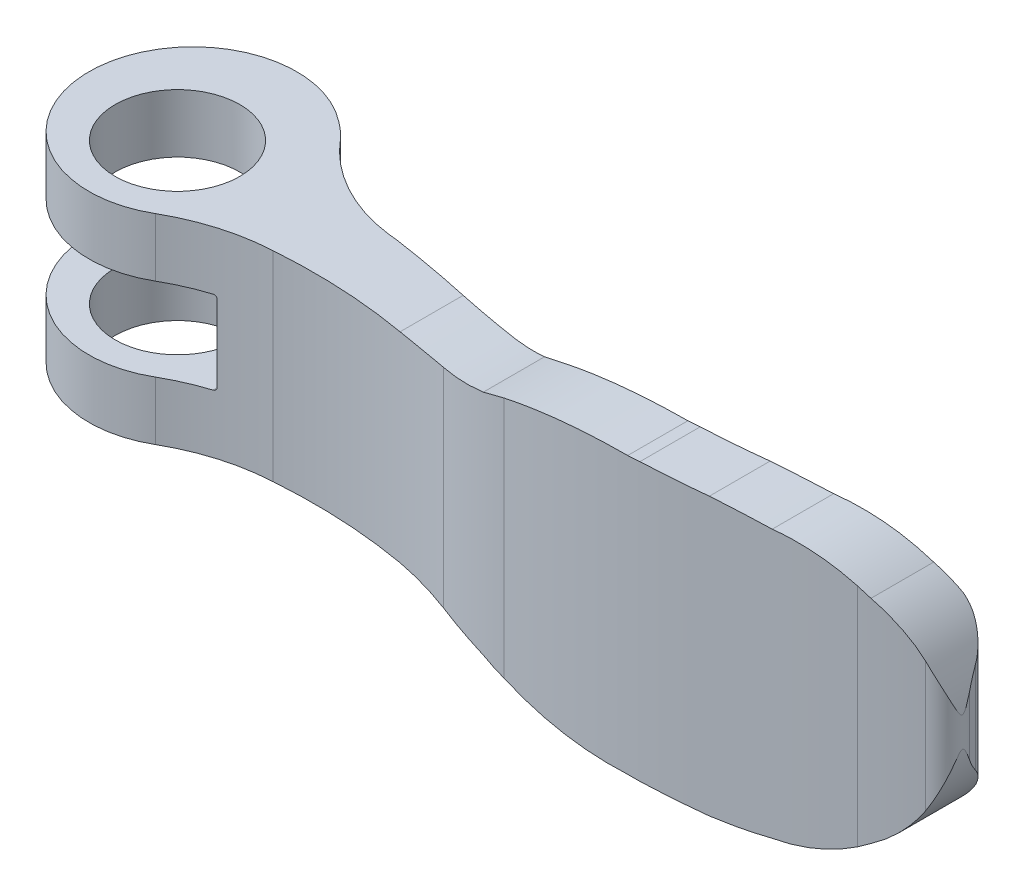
ISO-10303-21;
HEADER;
FILE_DESCRIPTION(('STEP AP214'),'2;1');
FILE_NAME('part.step','',(''),(''),'','','');
FILE_SCHEMA(('AUTOMOTIVE_DESIGN { 1 0 10303 214 1 1 1 1 }'));
ENDSEC;
DATA;
#1=APPLICATION_CONTEXT('core data for automotive mechanical design processes');
#2=APPLICATION_PROTOCOL_DEFINITION('international standard','automotive_design',2000,#1);
#3=PRODUCT_CONTEXT('',#1,'mechanical');
#4=PRODUCT('Part','Part','',(#3));
#5=PRODUCT_RELATED_PRODUCT_CATEGORY('part','',(#4));
#6=PRODUCT_DEFINITION_FORMATION('','',#4);
#7=PRODUCT_DEFINITION_CONTEXT('part definition',#1,'design');
#8=PRODUCT_DEFINITION('design','',#6,#7);
#9=PRODUCT_DEFINITION_SHAPE('','',#8);
#10=(LENGTH_UNIT() NAMED_UNIT(*) SI_UNIT(.MILLI.,.METRE.));
#11=(NAMED_UNIT(*) PLANE_ANGLE_UNIT() SI_UNIT($,.RADIAN.));
#12=(NAMED_UNIT(*) SI_UNIT($,.STERADIAN.) SOLID_ANGLE_UNIT());
#13=UNCERTAINTY_MEASURE_WITH_UNIT(LENGTH_MEASURE(1.E-05),#10,'distance_accuracy_value','');
#14=(GEOMETRIC_REPRESENTATION_CONTEXT(3) GLOBAL_UNCERTAINTY_ASSIGNED_CONTEXT((#13)) GLOBAL_UNIT_ASSIGNED_CONTEXT((#10,
#11,#12)) REPRESENTATION_CONTEXT('',''));
#15=CARTESIAN_POINT('',(0.,0.,0.));
#16=DIRECTION('',(0.,0.,1.));
#17=DIRECTION('',(1.,0.,0.));
#18=AXIS2_PLACEMENT_3D('',#15,#16,#17);
#19=CARTESIAN_POINT('',(11.9,-9.,38.));
#20=DIRECTION('',(0.,1.,0.));
#21=DIRECTION('',(-1.,0.,0.));
#22=AXIS2_PLACEMENT_3D('',#19,#20,#21);
#23=CYLINDRICAL_SURFACE('',#22,35.);
#24=CARTESIAN_POINT('',(11.9,6.5,38.));
#25=DIRECTION('',(0.,-1.,0.));
#26=DIRECTION('',(1.,0.,0.));
#27=AXIS2_PLACEMENT_3D('',#24,#25,#26);
#28=CIRCLE('',#27,35.);
#29=CARTESIAN_POINT('',(9.30000000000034,6.5,3.09670502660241));
#30=VERTEX_POINT('',#29);
#31=CARTESIAN_POINT('',(18.,6.5,3.53567061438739));
#32=VERTEX_POINT('',#31);
#33=EDGE_CURVE('E549',#30,#32,#28,.T.);
#34=ORIENTED_EDGE('',*,*,#33,.F.);
#35=DIRECTION('',(0.,1.,0.));
#36=VECTOR('',#35,1.);
#37=CARTESIAN_POINT('',(9.30000000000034,-9.,3.09670502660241));
#38=LINE('',#37,#36);
#39=CARTESIAN_POINT('',(9.30000000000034,-6.5,3.09670502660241));
#40=VERTEX_POINT('',#39);
#41=EDGE_CURVE('E491',#40,#30,#38,.T.);
#42=ORIENTED_EDGE('',*,*,#41,.F.);
#43=CARTESIAN_POINT('',(11.9,-6.5,38.));
#44=DIRECTION('',(0.,1.,0.));
#45=DIRECTION('',(-1.,0.,0.));
#46=AXIS2_PLACEMENT_3D('',#43,#44,#45);
#47=CIRCLE('',#46,35.);
#48=CARTESIAN_POINT('',(18.,-6.5,3.53567061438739));
#49=VERTEX_POINT('',#48);
#50=EDGE_CURVE('E684',#49,#40,#47,.T.);
#51=ORIENTED_EDGE('',*,*,#50,.F.);
#52=CARTESIAN_POINT('',(18.,-6.5,3.53567061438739));
#53=CARTESIAN_POINT('',(18.3131381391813,-6.50431301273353,3.5910883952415));
#54=CARTESIAN_POINT('',(18.6254495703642,-6.51337142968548,3.65077312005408));
#55=CARTESIAN_POINT('',(19.2474570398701,-6.54077256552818,3.77843645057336));
#56=CARTESIAN_POINT('',(19.5571563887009,-6.55910083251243,3.84640202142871));
#57=CARTESIAN_POINT('',(20.1739509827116,-6.60484951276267,3.99055947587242));
#58=CARTESIAN_POINT('',(20.4810462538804,-6.63226983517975,4.06675127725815));
#59=CARTESIAN_POINT('',(21.0926775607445,-6.69602553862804,4.22730553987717));
#60=CARTESIAN_POINT('',(21.3972088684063,-6.73237473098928,4.31168053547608));
#61=CARTESIAN_POINT('',(21.7,-6.773056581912,4.4));
#62=B_SPLINE_CURVE_WITH_KNOTS('',3,(#52,#53,#54,#55,#56,#57,#58,#59,#60,#61),.UNSPECIFIED.,.F.,
.F.,(4,2,2,2,4),(0.,0.954026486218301,1.90657018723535,2.85910437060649,3.81312133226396),.UNSPECIFIED.);
#63=CARTESIAN_POINT('',(21.7,-6.77305658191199,4.4));
#64=VERTEX_POINT('',#63);
#65=EDGE_CURVE('E612',#49,#64,#62,.T.);
#66=ORIENTED_EDGE('',*,*,#65,.T.);
#67=DIRECTION('',(0.,1.,0.));
#68=VECTOR('',#67,1.);
#69=CARTESIAN_POINT('',(21.7,-9.,4.4));
#70=LINE('',#69,#68);
#71=CARTESIAN_POINT('',(21.7,6.773056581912,4.4));
#72=VERTEX_POINT('',#71);
#73=EDGE_CURVE('E488',#64,#72,#70,.T.);
#74=ORIENTED_EDGE('',*,*,#73,.T.);
#75=CARTESIAN_POINT('',(21.7,6.773056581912,4.4));
#76=CARTESIAN_POINT('',(21.3972088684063,6.73237473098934,4.31168053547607));
#77=CARTESIAN_POINT('',(21.0926775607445,6.69602553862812,4.22730553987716));
#78=CARTESIAN_POINT('',(20.4810462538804,6.63226983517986,4.06675127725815));
#79=CARTESIAN_POINT('',(20.1739509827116,6.60484951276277,3.99055947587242));
#80=CARTESIAN_POINT('',(19.5571563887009,6.55910083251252,3.84640202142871));
#81=CARTESIAN_POINT('',(19.2474570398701,6.54077256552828,3.77843645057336));
#82=CARTESIAN_POINT('',(18.6254495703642,6.51337142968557,3.65077312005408));
#83=CARTESIAN_POINT('',(18.3131381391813,6.50431301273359,3.5910883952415));
#84=CARTESIAN_POINT('',(18.,6.5,3.53567061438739));
#85=B_SPLINE_CURVE_WITH_KNOTS('',3,(#75,#76,#77,#78,#79,#80,#81,#82,#83,#84),.UNSPECIFIED.,.F.,
.F.,(4,2,2,2,4),(0.,0.954016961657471,1.90655114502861,2.85909484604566,3.81312133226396),.UNSPECIFIED.);
#86=EDGE_CURVE('E647',#72,#32,#85,.T.);
#87=ORIENTED_EDGE('',*,*,#86,.T.);
#88=EDGE_LOOP('',(#34,#42,#51,#66,#74,#87));
#89=FACE_BOUND('',#88,.T.);
#90=ADVANCED_FACE('F14',(#89),#23,.F.);
#91=CARTESIAN_POINT('',(27.636582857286,-9.,-14.6986120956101));
#92=DIRECTION('',(0.,1.,0.));
#93=DIRECTION('',(-1.,0.,0.));
#94=AXIS2_PLACEMENT_3D('',#91,#92,#93);
#95=CYLINDRICAL_SURFACE('',#94,20.);
#96=CARTESIAN_POINT('',(21.7,6.773056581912,4.4));
#97=CARTESIAN_POINT('',(21.9720637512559,6.80959553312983,4.48457881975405));
#98=CARTESIAN_POINT('',(22.2454652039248,6.85001359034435,4.56317639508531));
#99=CARTESIAN_POINT('',(22.793478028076,6.93861161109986,4.70820025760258));
#100=CARTESIAN_POINT('',(23.0680846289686,6.98677180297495,4.77465665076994));
#101=CARTESIAN_POINT('',(23.6184172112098,7.09104023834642,4.89561464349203));
#102=CARTESIAN_POINT('',(23.8941431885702,7.14714845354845,4.95011628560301));
#103=CARTESIAN_POINT('',(24.4466473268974,7.26748584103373,5.047356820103));
#104=CARTESIAN_POINT('',(24.7234263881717,7.33173512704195,5.09006571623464));
#105=CARTESIAN_POINT('',(25.,7.4,5.12683697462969));
#106=B_SPLINE_CURVE_WITH_KNOTS('',3,(#96,#97,#98,#99,#100,#101,#102,#103,#104,#105),
.UNSPECIFIED.,.F.,.F.,(4,2,2,2,4),(0.,0.861630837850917,1.72109523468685,2.58055657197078,
3.44218432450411),.UNSPECIFIED.);
#107=CARTESIAN_POINT('',(25.,7.4,5.1268369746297));
#108=VERTEX_POINT('',#107);
#109=EDGE_CURVE('E628',#72,#108,#106,.T.);
#110=ORIENTED_EDGE('',*,*,#109,.F.);
#111=ORIENTED_EDGE('',*,*,#73,.F.);
#112=CARTESIAN_POINT('',(25.,-7.4,5.12683697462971));
#113=CARTESIAN_POINT('',(24.7234263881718,-7.33173512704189,5.09006571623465));
#114=CARTESIAN_POINT('',(24.4466473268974,-7.26748584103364,5.04735682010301));
#115=CARTESIAN_POINT('',(23.8941431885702,-7.14714845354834,4.95011628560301));
#116=CARTESIAN_POINT('',(23.6184172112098,-7.09104023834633,4.89561464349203));
#117=CARTESIAN_POINT('',(23.0680846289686,-6.98677180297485,4.77465665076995));
#118=CARTESIAN_POINT('',(22.7934780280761,-6.93861161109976,4.70820025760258));
#119=CARTESIAN_POINT('',(22.2454652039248,-6.85001359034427,4.56317639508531));
#120=CARTESIAN_POINT('',(21.9720637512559,-6.80959553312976,4.48457881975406));
#121=CARTESIAN_POINT('',(21.7,-6.77305658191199,4.4));
#122=B_SPLINE_CURVE_WITH_KNOTS('',3,(#112,#113,#114,#115,#116,#117,#118,#119,#120,#121),
.UNSPECIFIED.,.F.,.F.,(4,2,2,2,4),(0.,0.861627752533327,1.72108908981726,2.5805534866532,
3.44218432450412),.UNSPECIFIED.);
#123=CARTESIAN_POINT('',(25.,-7.4,5.12683697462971));
#124=VERTEX_POINT('',#123);
#125=EDGE_CURVE('E607',#124,#64,#122,.T.);
#126=ORIENTED_EDGE('',*,*,#125,.F.);
#127=CARTESIAN_POINT('',(25.,-7.4,5.12683697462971));
#128=CARTESIAN_POINT('',(25.1233706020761,-7.44420439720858,5.14324433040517));
#129=CARTESIAN_POINT('',(25.2471950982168,-7.48755703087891,5.15853945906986));
#130=CARTESIAN_POINT('',(25.495630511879,-7.57250661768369,5.18685853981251));
#131=CARTESIAN_POINT('',(25.6202409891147,-7.6141044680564,5.19988366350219));
#132=CARTESIAN_POINT('',(25.8702551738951,-7.6955382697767,5.22363311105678));
#133=CARTESIAN_POINT('',(25.9956588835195,-7.73537421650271,5.23435742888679));
#134=CARTESIAN_POINT('',(26.247262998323,-7.81327676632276,5.25347350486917));
#135=CARTESIAN_POINT('',(26.3734637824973,-7.85134244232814,5.26186405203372));
#136=CARTESIAN_POINT('',(26.5,-7.88849866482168,5.26906627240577));
#137=B_SPLINE_CURVE_WITH_KNOTS('',3,(#127,#128,#129,#130,#131,#132,#133,#134,#135,#136),
.UNSPECIFIED.,.F.,.F.,(4,2,2,2,4),(0.,0.396214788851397,0.792224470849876,1.18823519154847,
1.58445101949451),.UNSPECIFIED.);
#138=CARTESIAN_POINT('',(26.5,-7.88849866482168,5.26906627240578));
#139=VERTEX_POINT('',#138);
#140=EDGE_CURVE('E633',#124,#139,#137,.T.);
#141=ORIENTED_EDGE('',*,*,#140,.T.);
#142=DIRECTION('',(0.,1.,0.));
#143=VECTOR('',#142,1.);
#144=CARTESIAN_POINT('',(26.5,-9.,5.26906627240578));
#145=LINE('',#144,#143);
#146=CARTESIAN_POINT('',(26.5,7.88849866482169,5.26906627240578));
#147=VERTEX_POINT('',#146);
#148=EDGE_CURVE('E485',#139,#147,#145,.T.);
#149=ORIENTED_EDGE('',*,*,#148,.T.);
#150=CARTESIAN_POINT('',(26.5,7.88849866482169,5.26906627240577));
#151=CARTESIAN_POINT('',(26.3734637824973,7.85134244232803,5.26186405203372));
#152=CARTESIAN_POINT('',(26.2472629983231,7.81327676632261,5.25347350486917));
#153=CARTESIAN_POINT('',(25.9956588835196,7.73537421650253,5.23435742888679));
#154=CARTESIAN_POINT('',(25.8702551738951,7.69553826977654,5.22363311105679));
#155=CARTESIAN_POINT('',(25.6202409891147,7.61410446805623,5.1998836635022));
#156=CARTESIAN_POINT('',(25.495630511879,7.57250661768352,5.18685853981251));
#157=CARTESIAN_POINT('',(25.2471950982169,7.48755703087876,5.15853945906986));
#158=CARTESIAN_POINT('',(25.1233706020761,7.44420439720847,5.14324433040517));
#159=CARTESIAN_POINT('',(25.,7.4,5.12683697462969));
#160=B_SPLINE_CURVE_WITH_KNOTS('',3,(#150,#151,#152,#153,#154,#155,#156,#157,#158,#159),
.UNSPECIFIED.,.F.,.F.,(4,2,2,2,4),(0.,0.396215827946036,0.792226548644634,1.18823623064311,
1.58445101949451),.UNSPECIFIED.);
#161=EDGE_CURVE('E690',#147,#108,#160,.T.);
#162=ORIENTED_EDGE('',*,*,#161,.T.);
#163=EDGE_LOOP('',(#110,#111,#126,#141,#149,#162));
#164=FACE_BOUND('',#163,.T.);
#165=ADVANCED_FACE('F618',(#164),#95,.T.);
#166=CARTESIAN_POINT('',(51.8787175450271,-9.,0.00912105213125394));
#167=DIRECTION('',(-0.91914503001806,0.,0.393919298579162));
#168=DIRECTION('',(-0.393919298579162,0.,-0.91914503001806));
#169=AXIS2_PLACEMENT_3D('',#166,#167,#168);
#170=PLANE('',#169);
#171=DIRECTION('',(0.,1.,0.));
#172=VECTOR('',#171,1.);
#173=CARTESIAN_POINT('',(51.8787175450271,-9.,0.00912105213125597));
#174=LINE('',#173,#172);
#175=CARTESIAN_POINT('',(51.8787175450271,-3.00676504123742,0.00912105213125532));
#176=VERTEX_POINT('',#175);
#177=CARTESIAN_POINT('',(51.8787175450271,3.00676504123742,0.00912105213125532));
#178=VERTEX_POINT('',#177);
#179=EDGE_CURVE('E476',#176,#178,#174,.T.);
#180=ORIENTED_EDGE('',*,*,#179,.T.);
#181=CARTESIAN_POINT('',(44.8156496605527,0.48425199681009,-16.4713706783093));
#182=DIRECTION('',(-0.91914503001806,0.,0.393919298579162));
#183=DIRECTION('',(-0.393919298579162,0.,-0.91914503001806));
#184=AXIS2_PLACEMENT_3D('',#181,#182,#183);
#185=ELLIPSE('',#184,19.03943276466,7.5);
#186=CARTESIAN_POINT('',(52.1787175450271,1.91086733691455,0.709121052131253));
#187=VERTEX_POINT('',#186);
#188=EDGE_CURVE('E457',#178,#187,#185,.F.);
#189=ORIENTED_EDGE('',*,*,#188,.T.);
#190=DIRECTION('',(0.,1.,0.));
#191=VECTOR('',#190,1.);
#192=CARTESIAN_POINT('',(52.1787175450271,-9.,0.709121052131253));
#193=LINE('',#192,#191);
#194=CARTESIAN_POINT('',(52.1787175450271,-1.91086733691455,0.709121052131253));
#195=VERTEX_POINT('',#194);
#196=EDGE_CURVE('E473',#195,#187,#193,.T.);
#197=ORIENTED_EDGE('',*,*,#196,.F.);
#198=CARTESIAN_POINT('',(44.8156496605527,-0.484251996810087,-16.4713706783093));
#199=DIRECTION('',(-0.91914503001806,0.,0.393919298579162));
#200=DIRECTION('',(-0.393919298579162,0.,-0.91914503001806));
#201=AXIS2_PLACEMENT_3D('',#198,#199,#200);
#202=ELLIPSE('',#201,19.03943276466,7.5);
#203=EDGE_CURVE('E435',#195,#176,#202,.F.);
#204=ORIENTED_EDGE('',*,*,#203,.T.);
#205=EDGE_LOOP('',(#180,#189,#197,#204));
#206=FACE_BOUND('',#205,.T.);
#207=ADVANCED_FACE('F446',(#206),#170,.F.);
#208=CARTESIAN_POINT('',(29.1000000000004,-9.,-22.5000000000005));
#209=DIRECTION('',(0.,1.,0.));
#210=DIRECTION('',(-1.,0.,0.));
#211=AXIS2_PLACEMENT_3D('',#208,#209,#210);
#212=CYLINDRICAL_SURFACE('',#211,24.0000000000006);
#213=DIRECTION('',(0.,1.,0.));
#214=VECTOR('',#213,1.);
#215=CARTESIAN_POINT('',(22.5999999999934,-9.,0.603030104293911));
#216=LINE('',#215,#214);
#217=CARTESIAN_POINT('',(22.5999999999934,-6.90743883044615,0.603030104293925));
#218=VERTEX_POINT('',#217);
#219=CARTESIAN_POINT('',(22.5999999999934,6.90743883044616,0.603030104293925));
#220=VERTEX_POINT('',#219);
#221=EDGE_CURVE('E1152',#218,#220,#216,.T.);
#222=ORIENTED_EDGE('',*,*,#221,.T.);
#223=CARTESIAN_POINT('',(22.5999999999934,6.90743883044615,0.603030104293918));
#224=CARTESIAN_POINT('',(22.7990975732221,6.94015885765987,0.659048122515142));
#225=CARTESIAN_POINT('',(22.9986054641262,6.97494690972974,0.712399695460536));
#226=CARTESIAN_POINT('',(23.3979947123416,7.04865308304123,0.813719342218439));
#227=CARTESIAN_POINT('',(23.5978754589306,7.08756683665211,0.861693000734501));
#228=CARTESIAN_POINT('',(23.9979815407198,7.16958687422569,0.952323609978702));
#229=CARTESIAN_POINT('',(24.1982068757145,7.21269315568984,0.994980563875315));
#230=CARTESIAN_POINT('',(24.5989761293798,7.30315876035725,1.07504209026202));
#231=CARTESIAN_POINT('',(24.7995201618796,7.35052249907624,1.11244110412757));
#232=CARTESIAN_POINT('',(25.,7.4,1.14719856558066));
#233=B_SPLINE_CURVE_WITH_KNOTS('',3,(#223,#224,#225,#226,#227,#228,#229,#230,#231,#232),
.UNSPECIFIED.,.F.,.F.,(4,2,2,2,4),(0.,0.628173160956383,1.25568783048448,1.88320212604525,
2.51137491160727),.UNSPECIFIED.);
#234=CARTESIAN_POINT('',(25.,7.4,1.14719856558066));
#235=VERTEX_POINT('',#234);
#236=EDGE_CURVE('E655',#220,#235,#233,.T.);
#237=ORIENTED_EDGE('',*,*,#236,.T.);
#238=CARTESIAN_POINT('',(26.4999999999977,7.88849866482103,1.35875101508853));
#239=CARTESIAN_POINT('',(26.3733628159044,7.85131264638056,1.34495103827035));
#240=CARTESIAN_POINT('',(26.2470973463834,7.81322651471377,1.33017081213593));
#241=CARTESIAN_POINT('',(25.9954094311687,7.73529594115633,1.29868886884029));
#242=CARTESIAN_POINT('',(25.8699866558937,7.69545223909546,1.28198795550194));
#243=CARTESIAN_POINT('',(25.6199782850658,7.61401746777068,1.24669211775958));
#244=CARTESIAN_POINT('',(25.4953926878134,7.57242640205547,1.22809719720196));
#245=CARTESIAN_POINT('',(25.2470503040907,7.4875064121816,1.18903940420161));
#246=CARTESIAN_POINT('',(25.1232938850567,7.44417677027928,1.16857575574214));
#247=CARTESIAN_POINT('',(25.,7.4,1.14719856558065));
#248=B_SPLINE_CURVE_WITH_KNOTS('',3,(#238,#239,#240,#241,#242,#243,#244,#245,#246,#247),
.UNSPECIFIED.,.F.,.F.,(4,2,2,2,4),(0.,0.398102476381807,0.796038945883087,1.19397460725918,
1.59207627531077),.UNSPECIFIED.);
#249=CARTESIAN_POINT('',(26.4999999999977,7.88849866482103,1.35875101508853));
#250=VERTEX_POINT('',#249);
#251=EDGE_CURVE('E697',#250,#235,#248,.T.);
#252=ORIENTED_EDGE('',*,*,#251,.F.);
#253=DIRECTION('',(0.,1.,0.));
#254=VECTOR('',#253,1.);
#255=CARTESIAN_POINT('',(26.4999999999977,-9.,1.35875101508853));
#256=LINE('',#255,#254);
#257=CARTESIAN_POINT('',(26.4999999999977,-7.88849866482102,1.35875101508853));
#258=VERTEX_POINT('',#257);
#259=EDGE_CURVE('E1098',#258,#250,#256,.T.);
#260=ORIENTED_EDGE('',*,*,#259,.F.);
#261=CARTESIAN_POINT('',(25.,-7.4,1.14719856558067));
#262=CARTESIAN_POINT('',(25.1232938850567,-7.44417677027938,1.16857575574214));
#263=CARTESIAN_POINT('',(25.2470503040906,-7.48750641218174,1.1890394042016));
#264=CARTESIAN_POINT('',(25.4953926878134,-7.57242640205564,1.22809719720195));
#265=CARTESIAN_POINT('',(25.6199782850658,-7.61401746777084,1.24669211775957));
#266=CARTESIAN_POINT('',(25.8699866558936,-7.69545223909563,1.28198795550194));
#267=CARTESIAN_POINT('',(25.9954094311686,-7.73529594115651,1.29868886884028));
#268=CARTESIAN_POINT('',(26.2470973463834,-7.81322651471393,1.33017081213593));
#269=CARTESIAN_POINT('',(26.3733628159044,-7.85131264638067,1.34495103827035));
#270=CARTESIAN_POINT('',(26.4999999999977,-7.88849866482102,1.35875101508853));
#271=B_SPLINE_CURVE_WITH_KNOTS('',3,(#261,#262,#263,#264,#265,#266,#267,#268,#269,#270),
.UNSPECIFIED.,.F.,.F.,(4,2,2,2,4),(0.,0.398101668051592,0.796037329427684,1.19397379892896,
1.59207627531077),.UNSPECIFIED.);
#272=CARTESIAN_POINT('',(25.,-7.4,1.14719856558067));
#273=VERTEX_POINT('',#272);
#274=EDGE_CURVE('E1134',#273,#258,#271,.T.);
#275=ORIENTED_EDGE('',*,*,#274,.F.);
#276=CARTESIAN_POINT('',(25.,-7.4,1.14719856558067));
#277=CARTESIAN_POINT('',(24.7995201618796,-7.35052249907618,1.11244110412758));
#278=CARTESIAN_POINT('',(24.5989761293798,-7.30315876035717,1.07504209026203));
#279=CARTESIAN_POINT('',(24.1982068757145,-7.21269315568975,0.994980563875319));
#280=CARTESIAN_POINT('',(23.9979815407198,-7.16958687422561,0.952323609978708));
#281=CARTESIAN_POINT('',(23.5978754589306,-7.08756683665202,0.861693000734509));
#282=CARTESIAN_POINT('',(23.3979947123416,-7.04865308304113,0.813719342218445));
#283=CARTESIAN_POINT('',(22.9986054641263,-6.97494690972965,0.71239969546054));
#284=CARTESIAN_POINT('',(22.7990975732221,-6.9401588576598,0.659048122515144));
#285=CARTESIAN_POINT('',(22.5999999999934,-6.90743883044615,0.603030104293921));
#286=B_SPLINE_CURVE_WITH_KNOTS('',3,(#276,#277,#278,#279,#280,#281,#282,#283,#284,#285),
.UNSPECIFIED.,.F.,.F.,(4,2,2,2,4),(0.,0.628172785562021,1.2556870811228,1.88320175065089,
2.51137491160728),.UNSPECIFIED.);
#287=EDGE_CURVE('E559',#273,#218,#286,.T.);
#288=ORIENTED_EDGE('',*,*,#287,.T.);
#289=EDGE_LOOP('',(#222,#237,#252,#260,#275,#288));
#290=FACE_BOUND('',#289,.T.);
#291=ADVANCED_FACE('F334',(#290),#212,.F.);
#292=CARTESIAN_POINT('',(2.10263349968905,-9.,71.7075866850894));
#293=DIRECTION('',(0.,1.,0.));
#294=DIRECTION('',(-1.,0.,0.));
#295=AXIS2_PLACEMENT_3D('',#292,#293,#294);
#296=CYLINDRICAL_SURFACE('',#295,73.9999999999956);
#297=DIRECTION('',(0.,1.,0.));
#298=VECTOR('',#297,1.);
#299=CARTESIAN_POINT('',(12.7,-9.,-1.529670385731));
#300=LINE('',#299,#298);
#301=CARTESIAN_POINT('',(12.7,-6.5,-1.529670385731));
#302=VERTEX_POINT('',#301);
#303=CARTESIAN_POINT('',(12.7,6.5,-1.529670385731));
#304=VERTEX_POINT('',#303);
#305=EDGE_CURVE('E1149',#302,#304,#300,.T.);
#306=ORIENTED_EDGE('',*,*,#305,.T.);
#307=CARTESIAN_POINT('',(2.10263349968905,6.5,71.7075866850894));
#308=DIRECTION('',(0.,-1.,0.));
#309=DIRECTION('',(1.,0.,0.));
#310=AXIS2_PLACEMENT_3D('',#307,#308,#309);
#311=CIRCLE('',#310,73.9999999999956);
#312=CARTESIAN_POINT('',(18.,6.5,-0.564633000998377));
#313=VERTEX_POINT('',#312);
#314=EDGE_CURVE('E1035',#304,#313,#311,.T.);
#315=ORIENTED_EDGE('',*,*,#314,.T.);
#316=CARTESIAN_POINT('',(22.5999999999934,6.90743883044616,0.603030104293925));
#317=CARTESIAN_POINT('',(22.2225874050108,6.84540618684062,0.494227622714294));
#318=CARTESIAN_POINT('',(21.8432567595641,6.79023976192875,0.388137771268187));
#319=CARTESIAN_POINT('',(21.0818839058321,6.6939465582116,0.181764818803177));
#320=CARTESIAN_POINT('',(20.6998467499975,6.6527983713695,0.081473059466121));
#321=CARTESIAN_POINT('',(19.9330208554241,6.58465683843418,-0.113258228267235));
#322=CARTESIAN_POINT('',(19.5482320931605,6.55766361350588,-0.207697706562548));
#323=CARTESIAN_POINT('',(18.7758957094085,6.51799962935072,-0.39068154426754));
#324=CARTESIAN_POINT('',(18.388344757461,6.50535093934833,-0.47921662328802));
#325=CARTESIAN_POINT('',(18.,6.5,-0.564633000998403));
#326=B_SPLINE_CURVE_WITH_KNOTS('',3,(#316,#317,#318,#319,#320,#321,#322,#323,#324,#325),
.UNSPECIFIED.,.F.,.F.,(4,2,2,2,4),(0.,1.19289020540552,2.38395042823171,3.57502084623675,
4.76792126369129),.UNSPECIFIED.);
#327=EDGE_CURVE('E587',#220,#313,#326,.T.);
#328=ORIENTED_EDGE('',*,*,#327,.F.);
#329=ORIENTED_EDGE('',*,*,#221,.F.);
#330=CARTESIAN_POINT('',(18.,-6.5,-0.564633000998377));
#331=CARTESIAN_POINT('',(18.388344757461,-6.50535093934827,-0.479216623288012));
#332=CARTESIAN_POINT('',(18.7758957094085,-6.51799962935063,-0.39068154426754));
#333=CARTESIAN_POINT('',(19.5482320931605,-6.55766361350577,-0.207697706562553));
#334=CARTESIAN_POINT('',(19.9330208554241,-6.58465683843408,-0.113258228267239));
#335=CARTESIAN_POINT('',(20.6998467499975,-6.65279837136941,0.0814730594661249));
#336=CARTESIAN_POINT('',(21.0818839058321,-6.6939465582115,0.181764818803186));
#337=CARTESIAN_POINT('',(21.8432567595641,-6.79023976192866,0.388137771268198));
#338=CARTESIAN_POINT('',(22.2225874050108,-6.84540618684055,0.494227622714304));
#339=CARTESIAN_POINT('',(22.5999999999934,-6.90743883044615,0.603030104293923));
#340=B_SPLINE_CURVE_WITH_KNOTS('',3,(#330,#331,#332,#333,#334,#335,#336,#337,#338,#339),
.UNSPECIFIED.,.F.,.F.,(4,2,2,2,4),(0.,1.19290041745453,2.38397083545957,3.57503105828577,
4.76792126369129),.UNSPECIFIED.);
#341=CARTESIAN_POINT('',(18.,-6.5,-0.564633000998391));
#342=VERTEX_POINT('',#341);
#343=EDGE_CURVE('E581',#342,#218,#340,.T.);
#344=ORIENTED_EDGE('',*,*,#343,.F.);
#345=CARTESIAN_POINT('',(2.10263349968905,-6.5,71.7075866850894));
#346=DIRECTION('',(0.,1.,0.));
#347=DIRECTION('',(-1.,0.,0.));
#348=AXIS2_PLACEMENT_3D('',#345,#346,#347);
#349=CIRCLE('',#348,73.9999999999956);
#350=EDGE_CURVE('E1031',#342,#302,#349,.T.);
#351=ORIENTED_EDGE('',*,*,#350,.T.);
#352=EDGE_LOOP('',(#306,#315,#328,#329,#344,#351));
#353=FACE_BOUND('',#352,.T.);
#354=ADVANCED_FACE('F594',(#353),#296,.T.);
#355=CARTESIAN_POINT('',(0.189099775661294,-9.,-0.793028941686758));
#356=DIRECTION('',(0.,1.,0.));
#357=DIRECTION('',(-1.,0.,0.));
#358=AXIS2_PLACEMENT_3D('',#355,#356,#357);
#359=CYLINDRICAL_SURFACE('',#358,6.79999999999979);
#360=DIRECTION('',(0.,1.,0.));
#361=VECTOR('',#360,1.);
#362=CARTESIAN_POINT('',(5.2,-9.,-5.38986251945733));
#363=LINE('',#362,#361);
#364=CARTESIAN_POINT('',(5.2,-6.5,-5.38986251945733));
#365=VERTEX_POINT('',#364);
#366=CARTESIAN_POINT('',(5.2,-2.7,-5.38986251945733));
#367=VERTEX_POINT('',#366);
#368=EDGE_CURVE('E1157',#365,#367,#363,.T.);
#369=ORIENTED_EDGE('',*,*,#368,.F.);
#370=CARTESIAN_POINT('',(0.189099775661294,-6.5,-0.793028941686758));
#371=DIRECTION('',(0.,1.,0.));
#372=DIRECTION('',(-1.,0.,0.));
#373=AXIS2_PLACEMENT_3D('',#370,#371,#372);
#374=CIRCLE('',#373,6.79999999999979);
#375=CARTESIAN_POINT('',(4.2,-6.5,-6.28417448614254));
#376=VERTEX_POINT('',#375);
#377=EDGE_CURVE('E1051',#365,#376,#374,.T.);
#378=ORIENTED_EDGE('',*,*,#377,.T.);
#379=DIRECTION('',(0.,1.,0.));
#380=VECTOR('',#379,1.);
#381=CARTESIAN_POINT('',(4.2,-9.,-6.28417448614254));
#382=LINE('',#381,#380);
#383=CARTESIAN_POINT('',(4.2,-2.7,-6.28417448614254));
#384=VERTEX_POINT('',#383);
#385=EDGE_CURVE('E1164',#376,#384,#382,.T.);
#386=ORIENTED_EDGE('',*,*,#385,.T.);
#387=CARTESIAN_POINT('',(0.189099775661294,-2.7,-0.793028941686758));
#388=DIRECTION('',(0.,-1.,0.));
#389=DIRECTION('',(1.,0.,0.));
#390=AXIS2_PLACEMENT_3D('',#387,#388,#389);
#391=CIRCLE('',#390,6.79999999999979);
#392=EDGE_CURVE('E1058',#384,#367,#391,.T.);
#393=ORIENTED_EDGE('',*,*,#392,.T.);
#394=EDGE_LOOP('',(#369,#378,#386,#393));
#395=FACE_BOUND('',#394,.T.);
#396=ADVANCED_FACE('F788',(#395),#359,.T.);
#397=CARTESIAN_POINT('',(0.,-9.,-1.));
#398=DIRECTION('',(0.,1.,0.));
#399=DIRECTION('',(-1.,0.,0.));
#400=AXIS2_PLACEMENT_3D('',#397,#398,#399);
#401=CYLINDRICAL_SURFACE('',#400,6.75);
#402=ORIENTED_EDGE('',*,*,#385,.F.);
#403=CARTESIAN_POINT('',(0.,-6.5,-1.));
#404=DIRECTION('',(0.,1.,0.));
#405=DIRECTION('',(-1.,0.,0.));
#406=AXIS2_PLACEMENT_3D('',#403,#404,#405);
#407=CIRCLE('',#406,6.75);
#408=CARTESIAN_POINT('',(3.40000000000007,-6.5,4.83116626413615));
#409=VERTEX_POINT('',#408);
#410=EDGE_CURVE('E507',#376,#409,#407,.T.);
#411=ORIENTED_EDGE('',*,*,#410,.T.);
#412=DIRECTION('',(0.,1.,0.));
#413=VECTOR('',#412,1.);
#414=CARTESIAN_POINT('',(3.40000000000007,-9.,4.83116626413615));
#415=LINE('',#414,#413);
#416=CARTESIAN_POINT('',(3.40000000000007,-2.7,4.83116626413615));
#417=VERTEX_POINT('',#416);
#418=EDGE_CURVE('E1030',#409,#417,#415,.T.);
#419=ORIENTED_EDGE('',*,*,#418,.T.);
#420=CARTESIAN_POINT('',(0.,-2.7,-1.));
#421=DIRECTION('',(0.,-1.,0.));
#422=DIRECTION('',(1.,0.,0.));
#423=AXIS2_PLACEMENT_3D('',#420,#421,#422);
#424=CIRCLE('',#423,6.75);
#425=EDGE_CURVE('E504',#417,#384,#424,.T.);
#426=ORIENTED_EDGE('',*,*,#425,.T.);
#427=EDGE_LOOP('',(#402,#411,#419,#426));
#428=FACE_BOUND('',#427,.T.);
#429=ADVANCED_FACE('F796',(#428),#401,.T.);
#430=CARTESIAN_POINT('',(9.9995299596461,-9.,16.3782959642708));
#431=DIRECTION('',(0.,1.,0.));
#432=DIRECTION('',(-1.,0.,0.));
#433=AXIS2_PLACEMENT_3D('',#430,#431,#432);
#434=CYLINDRICAL_SURFACE('',#433,13.2999999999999);
#435=CARTESIAN_POINT('',(9.9995299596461,6.5,16.3782959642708));
#436=DIRECTION('',(0.,-1.,0.));
#437=DIRECTION('',(1.,0.,0.));
#438=AXIS2_PLACEMENT_3D('',#435,#436,#437);
#439=CIRCLE('',#438,13.2999999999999);
#440=CARTESIAN_POINT('',(3.40000000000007,6.5,4.83116626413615));
#441=VERTEX_POINT('',#440);
#442=EDGE_CURVE('E1034',#441,#30,#439,.T.);
#443=ORIENTED_EDGE('',*,*,#442,.F.);
#444=CARTESIAN_POINT('',(3.40000000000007,2.7,4.83116626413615));
#445=VERTEX_POINT('',#444);
#446=EDGE_CURVE('E1168',#445,#441,#415,.T.);
#447=ORIENTED_EDGE('',*,*,#446,.F.);
#448=CARTESIAN_POINT('',(9.9995299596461,2.7,16.3782959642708));
#449=DIRECTION('',(0.,1.,0.));
#450=DIRECTION('',(-1.,0.,0.));
#451=AXIS2_PLACEMENT_3D('',#448,#449,#450);
#452=CIRCLE('',#451,13.2999999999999);
#453=CARTESIAN_POINT('',(6.,2.7,3.6939055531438));
#454=VERTEX_POINT('',#453);
#455=EDGE_CURVE('E31',#454,#445,#452,.T.);
#456=ORIENTED_EDGE('',*,*,#455,.F.);
#457=CARTESIAN_POINT('',(6.,2.7,3.6939055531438));
#458=CARTESIAN_POINT('',(6.01162354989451,2.70000779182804,3.69023983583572));
#459=CARTESIAN_POINT('',(6.02325374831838,2.69898700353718,3.68659093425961));
#460=CARTESIAN_POINT('',(6.04620916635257,2.69493545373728,3.67942220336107));
#461=CARTESIAN_POINT('',(6.05753415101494,2.69190318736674,3.67590247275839));
#462=CARTESIAN_POINT('',(6.07955413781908,2.68387174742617,3.66908970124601));
#463=CARTESIAN_POINT('',(6.09024845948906,2.67887049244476,3.66579690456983));
#464=CARTESIAN_POINT('',(6.11065591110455,2.6670159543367,3.65953925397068));
#465=CARTESIAN_POINT('',(6.12036965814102,2.66016384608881,3.65657419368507));
#466=CARTESIAN_POINT('',(6.1382678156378,2.64497013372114,3.65113052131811));
#467=CARTESIAN_POINT('',(6.14648463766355,2.63667048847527,3.64864152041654));
#468=CARTESIAN_POINT('',(6.16139977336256,2.61868649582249,3.64413648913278));
#469=CARTESIAN_POINT('',(6.16809796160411,2.60900203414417,3.6421204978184));
#470=CARTESIAN_POINT('',(6.17947010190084,2.58897950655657,3.63870505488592));
#471=CARTESIAN_POINT('',(6.18421918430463,2.57868793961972,3.63728267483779));
#472=CARTESIAN_POINT('',(6.19191858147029,2.55740167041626,3.63497960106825));
#473=CARTESIAN_POINT('',(6.19487110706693,2.5464078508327,3.63409824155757));
#474=CARTESIAN_POINT('',(6.19791176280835,2.52942710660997,3.63319101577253));
#475=CARTESIAN_POINT('',(6.19869452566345,2.52356716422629,3.63295758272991));
#476=CARTESIAN_POINT('',(6.19973834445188,2.51180582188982,3.63264636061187));
#477=CARTESIAN_POINT('',(6.20000018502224,2.50590449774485,3.63256833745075));
#478=CARTESIAN_POINT('',(6.20000000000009,2.50000000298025,3.63256836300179));
#479=B_SPLINE_CURVE_WITH_KNOTS('',3,(#457,#458,#459,#460,#461,#462,#463,#464,#465,#466,#467,
#468,#469,#470,#471,#472,#473,#474,#475,#476,#477,#478),.UNSPECIFIED.,.F.,.F.,(4,2,2,2,2,2,2,2,
2,2,4),(0.,0.0365234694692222,0.0730742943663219,0.109663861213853,0.146230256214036,
0.18187373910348,0.217520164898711,0.251622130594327,0.285682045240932,0.303409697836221,
0.321110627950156),.UNSPECIFIED.);
#480=CARTESIAN_POINT('',(6.2,2.50000000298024,3.63256836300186));
#481=VERTEX_POINT('',#480);
#482=EDGE_CURVE('E540',#454,#481,#479,.T.);
#483=ORIENTED_EDGE('',*,*,#482,.T.);
#484=DIRECTION('',(0.,1.,0.));
#485=VECTOR('',#484,1.);
#486=CARTESIAN_POINT('',(6.2,-9.,3.63256836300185));
#487=LINE('',#486,#485);
#488=CARTESIAN_POINT('',(6.2,-2.5,3.63256836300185));
#489=VERTEX_POINT('',#488);
#490=EDGE_CURVE('E548',#489,#481,#487,.T.);
#491=ORIENTED_EDGE('',*,*,#490,.F.);
#492=CARTESIAN_POINT('',(6.2,-2.5,3.63256836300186));
#493=CARTESIAN_POINT('',(6.20001100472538,-2.51090805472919,3.63256548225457));
#494=CARTESIAN_POINT('',(6.19910833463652,-2.52181064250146,3.63283417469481));
#495=CARTESIAN_POINT('',(6.19555985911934,-2.5432817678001,3.63389258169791));
#496=CARTESIAN_POINT('',(6.19291738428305,-2.55385090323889,3.63468130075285));
#497=CARTESIAN_POINT('',(6.18597261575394,-2.5743768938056,3.63675788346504));
#498=CARTESIAN_POINT('',(6.18167017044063,-2.58433369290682,3.63804579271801));
#499=CARTESIAN_POINT('',(6.17155394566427,-2.60337012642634,3.64108168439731));
#500=CARTESIAN_POINT('',(6.16573995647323,-2.61244963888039,3.64282973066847));
#501=CARTESIAN_POINT('',(6.15267379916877,-2.62965099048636,3.64677033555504));
#502=CARTESIAN_POINT('',(6.14539869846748,-2.63775375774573,3.64896999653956));
#503=CARTESIAN_POINT('',(6.12969823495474,-2.65262819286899,3.65373429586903));
#504=CARTESIAN_POINT('',(6.12127260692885,-2.65939955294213,3.65629901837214));
#505=CARTESIAN_POINT('',(6.10315829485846,-2.67170609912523,3.66183494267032));
#506=CARTESIAN_POINT('',(6.09343273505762,-2.67718150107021,3.66481824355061));
#507=CARTESIAN_POINT('',(6.07327330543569,-2.68642418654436,3.67102954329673));
#508=CARTESIAN_POINT('',(6.06283939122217,-2.69019136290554,3.67425755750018));
#509=CARTESIAN_POINT('',(6.04366842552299,-2.69537430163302,3.68021583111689));
#510=CARTESIAN_POINT('',(6.03500684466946,-2.6971087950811,3.68291732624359));
#511=CARTESIAN_POINT('',(6.01756299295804,-2.69942167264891,3.68837776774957));
#512=CARTESIAN_POINT('',(6.00878092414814,-2.7000017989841,3.6911366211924));
#513=CARTESIAN_POINT('',(6.,-2.7,3.6939055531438));
#514=B_SPLINE_CURVE_WITH_KNOTS('',3,(#492,#493,#494,#495,#496,#497,#498,#499,#500,#501,#502,
#503,#504,#505,#506,#507,#508,#509,#510,#511,#512,#513),.UNSPECIFIED.,.F.,.F.,(4,2,2,2,2,2,2,2,
2,2,4),(0.,0.0326752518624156,0.0652881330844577,0.0979039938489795,0.130524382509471,
0.163703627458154,0.19689053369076,0.231395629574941,0.265902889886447,0.293543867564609,
0.321143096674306),.UNSPECIFIED.);
#515=CARTESIAN_POINT('',(6.,-2.7,3.6939055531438));
#516=VERTEX_POINT('',#515);
#517=EDGE_CURVE('E552',#489,#516,#514,.T.);
#518=ORIENTED_EDGE('',*,*,#517,.T.);
#519=CARTESIAN_POINT('',(9.9995299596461,-2.7,16.3782959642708));
#520=DIRECTION('',(0.,-1.,0.));
#521=DIRECTION('',(1.,0.,0.));
#522=AXIS2_PLACEMENT_3D('',#519,#520,#521);
#523=CIRCLE('',#522,13.2999999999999);
#524=EDGE_CURVE('E1054',#417,#516,#523,.T.);
#525=ORIENTED_EDGE('',*,*,#524,.F.);
#526=ORIENTED_EDGE('',*,*,#418,.F.);
#527=CARTESIAN_POINT('',(9.9995299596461,-6.5,16.3782959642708));
#528=DIRECTION('',(0.,1.,0.));
#529=DIRECTION('',(-1.,0.,0.));
#530=AXIS2_PLACEMENT_3D('',#527,#528,#529);
#531=CIRCLE('',#530,13.2999999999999);
#532=EDGE_CURVE('E1023',#40,#409,#531,.T.);
#533=ORIENTED_EDGE('',*,*,#532,.F.);
#534=ORIENTED_EDGE('',*,*,#41,.T.);
#535=EDGE_LOOP('',(#443,#447,#456,#483,#491,#518,#525,#526,#533,#534));
#536=FACE_BOUND('',#535,.T.);
#537=ADVANCED_FACE('F16',(#536),#434,.F.);
#538=CARTESIAN_POINT('',(33.,-9.,-58.4));
#539=DIRECTION('',(0.,1.,0.));
#540=DIRECTION('',(-1.,0.,0.));
#541=AXIS2_PLACEMENT_3D('',#538,#539,#540);
#542=CYLINDRICAL_SURFACE('',#541,64.);
#543=CARTESIAN_POINT('',(35.6011147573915,9.,5.54712035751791));
#544=CARTESIAN_POINT('',(35.4726759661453,8.99614626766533,5.55234457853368));
#545=CARTESIAN_POINT('',(35.3442363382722,8.99193832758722,5.55718148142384));
#546=CARTESIAN_POINT('',(35.0873554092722,8.98281403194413,5.56608065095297));
#547=CARTESIAN_POINT('',(34.9589141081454,8.97789767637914,5.57014291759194));
#548=CARTESIAN_POINT('',(34.8304719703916,8.97262711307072,5.5738178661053));
#549=B_SPLINE_CURVE_WITH_KNOTS('',3,(#543,#544,#545,#546,#547,#548),.UNSPECIFIED.,.F.,.F.,(4,2,
4),(0.,0.385798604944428,0.77159720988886),.UNSPECIFIED.);
#550=CARTESIAN_POINT('',(35.6011147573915,9.,5.54712035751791));
#551=VERTEX_POINT('',#550);
#552=CARTESIAN_POINT('',(34.8304719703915,8.97262711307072,5.57381786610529));
#553=VERTEX_POINT('',#552);
#554=EDGE_CURVE('E1081',#551,#553,#549,.T.);
#555=ORIENTED_EDGE('',*,*,#554,.T.);
#556=CARTESIAN_POINT('',(34.8304719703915,8.97262711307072,5.57381786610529));
#557=CARTESIAN_POINT('',(34.4775400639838,8.98208663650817,5.58392008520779));
#558=CARTESIAN_POINT('',(34.1243779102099,8.98461976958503,5.59109744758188));
#559=CARTESIAN_POINT('',(33.4181588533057,8.97583198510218,5.59960760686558));
#560=CARTESIAN_POINT('',(33.0651019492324,8.96451119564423,5.60094045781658));
#561=CARTESIAN_POINT('',(32.0120567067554,8.91003144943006,5.59620323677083));
#562=CARTESIAN_POINT('',(31.3130457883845,8.84649123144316,5.58154351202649));
#563=CARTESIAN_POINT('',(29.9229432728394,8.66532923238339,5.52977029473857));
#564=CARTESIAN_POINT('',(29.2318514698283,8.54770886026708,5.49265738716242));
#565=CARTESIAN_POINT('',(28.2024074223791,8.33108321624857,5.4208647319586));
#566=CARTESIAN_POINT('',(27.8592275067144,8.2518141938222,5.39412002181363));
#567=CARTESIAN_POINT('',(27.1766530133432,8.0800394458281,5.33543766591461));
#568=CARTESIAN_POINT('',(26.8372583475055,7.98753402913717,5.30350014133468));
#569=CARTESIAN_POINT('',(26.5,7.88849866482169,5.26906627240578));
#570=B_SPLINE_CURVE_WITH_KNOTS('',3,(#556,#557,#558,#559,#560,#561,#562,#563,#564,#565,#566,
#567,#568,#569),.UNSPECIFIED.,.F.,.F.,(4,2,2,2,2,2,4),(0.,1.05945135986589,2.11889292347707,
4.22237122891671,6.32579473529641,7.38521594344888,8.44461243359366),.UNSPECIFIED.);
#571=EDGE_CURVE('E1095',#553,#147,#570,.T.);
#572=ORIENTED_EDGE('',*,*,#571,.T.);
#573=ORIENTED_EDGE('',*,*,#148,.F.);
#574=CARTESIAN_POINT('',(26.5,-7.88849866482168,5.26906627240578));
#575=CARTESIAN_POINT('',(26.8372583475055,-7.98753402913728,5.30350014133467));
#576=CARTESIAN_POINT('',(27.1766530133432,-8.08003944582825,5.3354376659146));
#577=CARTESIAN_POINT('',(27.8592275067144,-8.2518141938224,5.39412002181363));
#578=CARTESIAN_POINT('',(28.2024074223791,-8.33108321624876,5.4208647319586));
#579=CARTESIAN_POINT('',(29.2318514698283,-8.54770886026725,5.49265738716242));
#580=CARTESIAN_POINT('',(29.9229432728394,-8.66532923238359,5.52977029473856));
#581=CARTESIAN_POINT('',(31.3130457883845,-8.84649123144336,5.58154351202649));
#582=CARTESIAN_POINT('',(32.0120567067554,-8.91003144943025,5.59620323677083));
#583=CARTESIAN_POINT('',(33.0651019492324,-8.96451119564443,5.60094045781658));
#584=CARTESIAN_POINT('',(33.4181588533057,-8.9758319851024,5.59960760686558));
#585=CARTESIAN_POINT('',(34.1243779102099,-8.98461976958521,5.59109744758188));
#586=CARTESIAN_POINT('',(34.4775400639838,-8.98208663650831,5.58392008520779));
#587=CARTESIAN_POINT('',(34.8304719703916,-8.97262711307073,5.57381786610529));
#588=B_SPLINE_CURVE_WITH_KNOTS('',3,(#574,#575,#576,#577,#578,#579,#580,#581,#582,#583,#584,
#585,#586,#587),.UNSPECIFIED.,.F.,.F.,(4,2,2,2,2,2,4),(0.,1.0593964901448,2.11881769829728,
4.222241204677,6.32571951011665,7.38516107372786,8.44461243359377),.UNSPECIFIED.);
#589=CARTESIAN_POINT('',(34.8304719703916,-8.97262711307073,5.57381786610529));
#590=VERTEX_POINT('',#589);
#591=EDGE_CURVE('E639',#139,#590,#588,.T.);
#592=ORIENTED_EDGE('',*,*,#591,.T.);
#593=CARTESIAN_POINT('',(34.8304719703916,-8.97262711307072,5.57381786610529));
#594=CARTESIAN_POINT('',(34.9589141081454,-8.97789767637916,5.57014291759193));
#595=CARTESIAN_POINT('',(35.0873554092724,-8.98281403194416,5.56608065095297));
#596=CARTESIAN_POINT('',(35.3442363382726,-8.99193832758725,5.55718148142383));
#597=CARTESIAN_POINT('',(35.4726759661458,-8.99614626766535,5.55234457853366));
#598=CARTESIAN_POINT('',(35.6011147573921,-9.,5.54712035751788));
#599=B_SPLINE_CURVE_WITH_KNOTS('',3,(#593,#594,#595,#596,#597,#598),.UNSPECIFIED.,.F.,.F.,(4,2,
4),(0.,0.385798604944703,0.771597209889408),.UNSPECIFIED.);
#600=CARTESIAN_POINT('',(35.6011147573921,-9.,5.54712035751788));
#601=VERTEX_POINT('',#600);
#602=EDGE_CURVE('E1074',#590,#601,#599,.T.);
#603=ORIENTED_EDGE('',*,*,#602,.T.);
#604=CARTESIAN_POINT('',(33.,-9.,-58.4));
#605=DIRECTION('',(0.,-1.,0.));
#606=DIRECTION('',(1.,0.,0.));
#607=AXIS2_PLACEMENT_3D('',#604,#605,#606);
#608=CIRCLE('',#607,64.);
#609=CARTESIAN_POINT('',(39.7999999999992,-9.,5.2377246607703));
#610=VERTEX_POINT('',#609);
#611=EDGE_CURVE('E299',#610,#601,#608,.T.);
#612=ORIENTED_EDGE('',*,*,#611,.F.);
#613=CARTESIAN_POINT('',(39.8,-9.,5.23772466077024));
#614=CARTESIAN_POINT('',(40.1021113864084,-8.9888754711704,5.20544423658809));
#615=CARTESIAN_POINT('',(40.4038636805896,-8.97424366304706,5.17102298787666));
#616=CARTESIAN_POINT('',(41.0062194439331,-8.93802938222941,5.09797141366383));
#617=CARTESIAN_POINT('',(41.306823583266,-8.91645191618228,5.05934413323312));
#618=CARTESIAN_POINT('',(41.9068869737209,-8.86639411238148,4.9779065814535));
#619=CARTESIAN_POINT('',(42.2063462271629,-8.83791378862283,4.93509631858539));
#620=CARTESIAN_POINT('',(42.8041304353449,-8.77409009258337,4.84531992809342));
#621=CARTESIAN_POINT('',(43.102454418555,-8.73874179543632,4.79835083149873));
#622=CARTESIAN_POINT('',(43.4,-8.7,4.7493467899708));
#623=B_SPLINE_CURVE_WITH_KNOTS('',3,(#613,#614,#615,#616,#617,#618,#619,#620,#621,#622),
.UNSPECIFIED.,.F.,.F.,(4,2,2,2,4),(0.,0.912074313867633,1.82349264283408,2.73490912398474,
3.64698158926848),.UNSPECIFIED.);
#624=CARTESIAN_POINT('',(43.4,-8.7,4.74934678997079));
#625=VERTEX_POINT('',#624);
#626=EDGE_CURVE('E39',#610,#625,#623,.T.);
#627=ORIENTED_EDGE('',*,*,#626,.T.);
#628=CARTESIAN_POINT('',(43.4,-8.7,4.74934678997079));
#629=CARTESIAN_POINT('',(43.6889064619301,-8.68738385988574,4.70178755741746));
#630=CARTESIAN_POINT('',(43.9769274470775,-8.66219169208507,4.65229758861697));
#631=CARTESIAN_POINT('',(44.54922037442,-8.58711944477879,4.5499748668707));
#632=CARTESIAN_POINT('',(44.8334912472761,-8.53723247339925,4.49714118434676));
#633=CARTESIAN_POINT('',(45.3906428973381,-8.41445420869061,4.38973700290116));
#634=CARTESIAN_POINT('',(45.6636377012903,-8.34203166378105,4.33522064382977));
#635=CARTESIAN_POINT('',(46.2020276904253,-8.17455861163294,4.22413223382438));
#636=CARTESIAN_POINT('',(46.4674264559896,-8.07951896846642,4.16756118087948));
#637=CARTESIAN_POINT('',(46.9464292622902,-7.88481984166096,4.06236489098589));
#638=CARTESIAN_POINT('',(47.1614208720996,-7.78844218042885,4.01394860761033));
#639=CARTESIAN_POINT('',(47.5857365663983,-7.57995350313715,3.9161638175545));
#640=CARTESIAN_POINT('',(47.7949984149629,-7.46771795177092,3.86679073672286));
#641=CARTESIAN_POINT('',(48.0000000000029,-7.34816852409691,3.81736092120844));
#642=B_SPLINE_CURVE_WITH_KNOTS('',3,(#628,#629,#630,#631,#632,#633,#634,#635,#636,#637,#638,
#639,#640,#641),.UNSPECIFIED.,.F.,.F.,(4,2,2,2,2,2,4),(0.,0.878901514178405,1.7580484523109,
2.62000993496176,3.48155820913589,4.2025850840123,4.9296264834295),.UNSPECIFIED.);
#643=CARTESIAN_POINT('',(48.0000000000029,-7.34816852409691,3.81736092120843));
#644=VERTEX_POINT('',#643);
#645=EDGE_CURVE('E1114',#625,#644,#642,.T.);
#646=ORIENTED_EDGE('',*,*,#645,.T.);
#647=DIRECTION('',(0.,1.,0.));
#648=VECTOR('',#647,1.);
#649=CARTESIAN_POINT('',(48.0000000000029,-9.,3.81736092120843));
#650=LINE('',#649,#648);
#651=CARTESIAN_POINT('',(48.0000000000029,7.34816852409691,3.81736092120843));
#652=VERTEX_POINT('',#651);
#653=EDGE_CURVE('E278',#644,#652,#650,.T.);
#654=ORIENTED_EDGE('',*,*,#653,.T.);
#655=CARTESIAN_POINT('',(48.0000000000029,7.34816852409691,3.81736092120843));
#656=CARTESIAN_POINT('',(47.7521792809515,7.49270490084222,3.8771226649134));
#657=CARTESIAN_POINT('',(47.498095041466,7.62654754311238,3.93679936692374));
#658=CARTESIAN_POINT('',(46.9790566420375,7.87204872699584,4.05523496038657));
#659=CARTESIAN_POINT('',(46.7140970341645,7.98369598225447,4.11399337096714));
#660=CARTESIAN_POINT('',(46.1805407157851,8.18188503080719,4.22863919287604));
#661=CARTESIAN_POINT('',(45.9121191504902,8.26887905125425,4.28456038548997));
#662=CARTESIAN_POINT('',(45.3685815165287,8.41993017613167,4.39406796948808));
#663=CARTESIAN_POINT('',(45.0934692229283,8.48399990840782,4.44765563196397));
#664=CARTESIAN_POINT('',(44.5836153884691,8.58015190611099,4.54343230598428));
#665=CARTESIAN_POINT('',(44.3496115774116,8.6157478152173,4.5860544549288));
#666=CARTESIAN_POINT('',(43.877290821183,8.67051799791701,4.66934931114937));
#667=CARTESIAN_POINT('',(43.6389541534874,8.68955166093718,4.71000261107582));
#668=CARTESIAN_POINT('',(43.4,8.7,4.74934678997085));
#669=B_SPLINE_CURVE_WITH_KNOTS('',3,(#655,#656,#657,#658,#659,#660,#661,#662,#663,#664,#665,
#666,#667,#668),.UNSPECIFIED.,.F.,.F.,(4,2,2,2,2,2,4),(0.,0.878896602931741,1.75823898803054,
2.62021675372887,3.48171896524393,4.20264441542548,4.92963229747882),.UNSPECIFIED.);
#670=CARTESIAN_POINT('',(43.4,8.7,4.74934678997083));
#671=VERTEX_POINT('',#670);
#672=EDGE_CURVE('E266',#652,#671,#669,.T.);
#673=ORIENTED_EDGE('',*,*,#672,.T.);
#674=CARTESIAN_POINT('',(43.4,8.7,4.74934678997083));
#675=CARTESIAN_POINT('',(43.1024544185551,8.73874179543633,4.79835083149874));
#676=CARTESIAN_POINT('',(42.8041304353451,8.77409009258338,4.8453199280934));
#677=CARTESIAN_POINT('',(42.2063462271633,8.83791378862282,4.93509631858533));
#678=CARTESIAN_POINT('',(41.9068869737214,8.86639411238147,4.97790658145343));
#679=CARTESIAN_POINT('',(41.3068235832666,8.91645191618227,5.05934413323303));
#680=CARTESIAN_POINT('',(41.0062194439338,8.9380293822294,5.09797141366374));
#681=CARTESIAN_POINT('',(40.4038636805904,8.97424366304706,5.17102298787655));
#682=CARTESIAN_POINT('',(40.1021113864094,8.98887547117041,5.20544423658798));
#683=CARTESIAN_POINT('',(39.800000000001,9.,5.23772466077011));
#684=B_SPLINE_CURVE_WITH_KNOTS('',3,(#674,#675,#676,#677,#678,#679,#680,#681,#682,#683),
.UNSPECIFIED.,.F.,.F.,(4,2,2,2,4),(0.,0.912072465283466,1.82348894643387,2.73490727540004,
3.64698158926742),.UNSPECIFIED.);
#685=CARTESIAN_POINT('',(39.800000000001,9.,5.23772466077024));
#686=VERTEX_POINT('',#685);
#687=EDGE_CURVE('E250',#671,#686,#684,.T.);
#688=ORIENTED_EDGE('',*,*,#687,.T.);
#689=CARTESIAN_POINT('',(33.,9.,-58.4));
#690=DIRECTION('',(0.,-1.,0.));
#691=DIRECTION('',(1.,0.,0.));
#692=AXIS2_PLACEMENT_3D('',#689,#690,#691);
#693=CIRCLE('',#692,64.);
#694=EDGE_CURVE('E279',#686,#551,#693,.T.);
#695=ORIENTED_EDGE('',*,*,#694,.T.);
#696=EDGE_LOOP('',(#555,#572,#573,#592,#603,#612,#627,#646,#654,#673,#688,#695));
#697=FACE_BOUND('',#696,.T.);
#698=ADVANCED_FACE('F275',(#697),#542,.T.);
#699=CARTESIAN_POINT('',(43.3382724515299,-9.,-15.631759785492));
#700=DIRECTION('',(0.,1.,0.));
#701=DIRECTION('',(-1.,0.,0.));
#702=AXIS2_PLACEMENT_3D('',#699,#700,#701);
#703=CYLINDRICAL_SURFACE('',#702,20.);
#704=CARTESIAN_POINT('',(51.3130302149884,4.23045619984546,2.70953893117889));
#705=CARTESIAN_POINT('',(51.2033899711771,4.4206302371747,2.75721143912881));
#706=CARTESIAN_POINT('',(51.0856619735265,4.60550892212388,2.80723024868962));
#707=CARTESIAN_POINT('',(50.8349695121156,4.96371102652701,2.91056741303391));
#708=CARTESIAN_POINT('',(50.7020021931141,5.13703227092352,2.96388638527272));
#709=CARTESIAN_POINT('',(50.4246154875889,5.46774041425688,3.07132600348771));
#710=CARTESIAN_POINT('',(50.2804785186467,5.62537677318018,3.12540925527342));
#711=CARTESIAN_POINT('',(49.9794611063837,5.92764446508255,3.23408790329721));
#712=CARTESIAN_POINT('',(49.8225861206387,6.07228131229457,3.28868307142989));
#713=CARTESIAN_POINT('',(49.5101417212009,6.33661530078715,3.39277372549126));
#714=CARTESIAN_POINT('',(49.3554953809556,6.45738356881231,3.44232415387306));
#715=CARTESIAN_POINT('',(49.0354108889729,6.68770819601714,3.54038147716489));
#716=CARTESIAN_POINT('',(48.8698851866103,6.79714888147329,3.58887424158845));
#717=CARTESIAN_POINT('',(48.7,6.9,3.63613780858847));
#718=B_SPLINE_CURVE_WITH_KNOTS('',3,(#704,#705,#706,#707,#708,#709,#710,#711,#712,#713,#714,
#715,#716,#717),.UNSPECIFIED.,.F.,.F.,(4,2,2,2,2,2,4),(0.,0.673627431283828,1.347381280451,
2.00765244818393,2.66764220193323,3.27418461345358,3.88641100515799),.UNSPECIFIED.);
#719=CARTESIAN_POINT('',(51.3130302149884,4.23045619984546,2.70953893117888));
#720=VERTEX_POINT('',#719);
#721=CARTESIAN_POINT('',(48.7,6.9,3.63613780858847));
#722=VERTEX_POINT('',#721);
#723=EDGE_CURVE('E284',#720,#722,#718,.T.);
#724=ORIENTED_EDGE('',*,*,#723,.T.);
#725=CARTESIAN_POINT('',(48.7,6.9,3.63613780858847));
#726=CARTESIAN_POINT('',(48.6433594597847,6.93967618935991,3.65189940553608));
#727=CARTESIAN_POINT('',(48.5862796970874,6.9787840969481,3.66751395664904));
#728=CARTESIAN_POINT('',(48.4712858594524,7.05582850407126,3.69841650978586));
#729=CARTESIAN_POINT('',(48.4133721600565,7.09376550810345,3.71370465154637));
#730=CARTESIAN_POINT('',(48.2967049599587,7.16846802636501,3.74393577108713));
#731=CARTESIAN_POINT('',(48.2379514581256,7.20523353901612,3.75887874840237));
#732=CARTESIAN_POINT('',(48.1195989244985,7.27759070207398,3.78840085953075));
#733=CARTESIAN_POINT('',(48.0599995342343,7.3131818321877,3.8029798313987));
#734=CARTESIAN_POINT('',(48.0000000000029,7.34816852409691,3.81736092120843));
#735=B_SPLINE_CURVE_WITH_KNOTS('',3,(#725,#726,#727,#728,#729,#730,#731,#732,#733,#734),
.UNSPECIFIED.,.F.,.F.,(4,2,2,2,4),(0.,0.212780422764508,0.425467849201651,0.638155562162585,
0.850936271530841),.UNSPECIFIED.);
#736=EDGE_CURVE('E280',#722,#652,#735,.T.);
#737=ORIENTED_EDGE('',*,*,#736,.T.);
#738=ORIENTED_EDGE('',*,*,#653,.F.);
#739=CARTESIAN_POINT('',(48.0000000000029,-7.34816852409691,3.81736092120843));
#740=CARTESIAN_POINT('',(48.0599995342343,-7.3131818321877,3.8029798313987));
#741=CARTESIAN_POINT('',(48.1195989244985,-7.27759070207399,3.78840085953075));
#742=CARTESIAN_POINT('',(48.2379514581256,-7.20523353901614,3.75887874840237));
#743=CARTESIAN_POINT('',(48.2967049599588,-7.16846802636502,3.74393577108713));
#744=CARTESIAN_POINT('',(48.4133721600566,-7.09376550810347,3.71370465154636));
#745=CARTESIAN_POINT('',(48.4712858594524,-7.05582850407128,3.69841650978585));
#746=CARTESIAN_POINT('',(48.5862796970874,-6.97878409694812,3.66751395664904));
#747=CARTESIAN_POINT('',(48.6433594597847,-6.93967618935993,3.65189940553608));
#748=CARTESIAN_POINT('',(48.7,-6.9,3.63613780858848));
#749=B_SPLINE_CURVE_WITH_KNOTS('',3,(#739,#740,#741,#742,#743,#744,#745,#746,#747,#748),
.UNSPECIFIED.,.F.,.F.,(4,2,2,2,4),(0.,0.212780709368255,0.425468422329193,0.638155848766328,
0.850936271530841),.UNSPECIFIED.);
#750=CARTESIAN_POINT('',(48.7,-6.9,3.63613780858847));
#751=VERTEX_POINT('',#750);
#752=EDGE_CURVE('E1099',#644,#751,#749,.T.);
#753=ORIENTED_EDGE('',*,*,#752,.T.);
#754=CARTESIAN_POINT('',(48.7,-6.9,3.63613780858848));
#755=CARTESIAN_POINT('',(48.8869333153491,-6.78683128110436,3.58413568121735));
#756=CARTESIAN_POINT('',(49.0685925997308,-6.66567586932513,3.53063789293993));
#757=CARTESIAN_POINT('',(49.4204122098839,-6.40824234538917,3.4218835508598));
#758=CARTESIAN_POINT('',(49.590568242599,-6.27195863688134,3.36662635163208));
#759=CARTESIAN_POINT('',(49.9149855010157,-5.98809610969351,3.2567455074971));
#760=CARTESIAN_POINT('',(50.0694980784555,-5.84080051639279,3.20213156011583));
#761=CARTESIAN_POINT('',(50.3654766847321,-5.53349979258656,3.09370998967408));
#762=CARTESIAN_POINT('',(50.5069489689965,-5.37350082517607,3.03990199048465));
#763=CARTESIAN_POINT('',(50.7651151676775,-5.05507163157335,2.93863737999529));
#764=CARTESIAN_POINT('',(50.8828881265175,-4.8975666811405,2.89101959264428));
#765=CARTESIAN_POINT('',(51.1070866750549,-4.5717104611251,2.79811792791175));
#766=CARTESIAN_POINT('',(51.2133947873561,-4.40327091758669,2.75286029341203));
#767=CARTESIAN_POINT('',(51.3130302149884,-4.23045619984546,2.70953893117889));
#768=B_SPLINE_CURVE_WITH_KNOTS('',3,(#754,#755,#756,#757,#758,#759,#760,#761,#762,#763,#764,
#765,#766,#767),.UNSPECIFIED.,.F.,.F.,(4,2,2,2,2,2,4),(0.,0.673636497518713,1.34752302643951,
2.00781891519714,2.66779639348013,3.27424553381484,3.88641343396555),.UNSPECIFIED.);
#769=CARTESIAN_POINT('',(51.3130302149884,-4.23045619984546,2.70953893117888));
#770=VERTEX_POINT('',#769);
#771=EDGE_CURVE('E434',#751,#770,#768,.T.);
#772=ORIENTED_EDGE('',*,*,#771,.T.);
#773=DIRECTION('',(0.,1.,0.));
#774=VECTOR('',#773,1.);
#775=CARTESIAN_POINT('',(51.3130302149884,-9.,2.70953893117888));
#776=LINE('',#775,#774);
#777=EDGE_CURVE('E467',#770,#720,#776,.T.);
#778=ORIENTED_EDGE('',*,*,#777,.T.);
#779=EDGE_LOOP('',(#724,#737,#738,#753,#772,#778));
#780=FACE_BOUND('',#779,.T.);
#781=ADVANCED_FACE('F444',(#780),#703,.T.);
#782=CARTESIAN_POINT('',(50.8,-9.,1.3));
#783=DIRECTION('',(0.,1.,0.));
#784=DIRECTION('',(-1.,0.,0.));
#785=AXIS2_PLACEMENT_3D('',#782,#783,#784);
#786=CYLINDRICAL_SURFACE('',#785,1.5);
#787=ORIENTED_EDGE('',*,*,#196,.T.);
#788=CARTESIAN_POINT('',(52.1787175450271,1.91086733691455,0.709121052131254));
#789=CARTESIAN_POINT('',(52.1858807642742,1.87389795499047,0.72583927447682));
#790=CARTESIAN_POINT('',(52.1927523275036,1.83693987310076,0.742708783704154));
#791=CARTESIAN_POINT('',(52.2059211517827,1.76303908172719,0.7768159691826));
#792=CARTESIAN_POINT('',(52.2122177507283,1.72609643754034,0.794054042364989));
#793=CARTESIAN_POINT('',(52.2244221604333,1.65111913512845,0.829485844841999));
#794=CARTESIAN_POINT('',(52.2303110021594,1.61308749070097,0.847692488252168));
#795=CARTESIAN_POINT('',(52.2414639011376,1.53722412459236,0.884604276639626));
#796=CARTESIAN_POINT('',(52.2467286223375,1.4993922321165,0.903308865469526));
#797=CARTESIAN_POINT('',(52.2566330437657,1.42404439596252,0.941382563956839));
#798=CARTESIAN_POINT('',(52.2612735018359,1.38652812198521,0.96075083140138));
#799=CARTESIAN_POINT('',(52.2699476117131,1.31181128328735,1.00054516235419));
#800=CARTESIAN_POINT('',(52.2739792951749,1.27461209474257,1.02097438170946));
#801=CARTESIAN_POINT('',(52.2813301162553,1.20184509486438,1.06313165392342));
#802=CARTESIAN_POINT('',(52.2846608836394,1.16625991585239,1.08482931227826));
#803=CARTESIAN_POINT('',(52.2906555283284,1.09698493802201,1.1311240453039));
#804=CARTESIAN_POINT('',(52.2933239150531,1.06328360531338,1.15569973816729));
#805=CARTESIAN_POINT('',(52.2960064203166,1.02675438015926,1.19045786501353));
#806=CARTESIAN_POINT('',(52.296460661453,1.0204462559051,1.19680823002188));
#807=CARTESIAN_POINT('',(52.2973156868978,1.00837901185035,1.21005145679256));
#808=CARTESIAN_POINT('',(52.2977163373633,1.00262127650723,1.21694561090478));
#809=CARTESIAN_POINT('',(52.2984524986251,0.99188486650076,1.23148817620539));
#810=CARTESIAN_POINT('',(52.2987870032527,0.98691842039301,1.2391459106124));
#811=CARTESIAN_POINT('',(52.2993528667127,0.978422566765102,1.25522582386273));
#812=CARTESIAN_POINT('',(52.2995847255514,0.974886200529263,1.26364405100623));
#813=CARTESIAN_POINT('',(52.2998462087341,0.970877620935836,1.2778353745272));
#814=CARTESIAN_POINT('',(52.2999190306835,0.969754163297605,1.28342107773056));
#815=CARTESIAN_POINT('',(52.3000012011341,0.96848589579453,1.29470192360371));
#816=CARTESIAN_POINT('',(52.3000106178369,0.968340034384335,1.30039694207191));
#817=CARTESIAN_POINT('',(52.2999649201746,0.96904595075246,1.3117179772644));
#818=CARTESIAN_POINT('',(52.2999098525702,0.969897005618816,1.31734404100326));
#819=CARTESIAN_POINT('',(52.2997415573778,0.972483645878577,1.32838799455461));
#820=CARTESIAN_POINT('',(52.2996282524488,0.974220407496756,1.33380559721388));
#821=CARTESIAN_POINT('',(52.2992769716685,0.979562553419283,1.34728822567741));
#822=CARTESIAN_POINT('',(52.2990047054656,0.983669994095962,1.35515031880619));
#823=CARTESIAN_POINT('',(52.298376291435,0.99300029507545,1.37017788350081));
#824=CARTESIAN_POINT('',(52.2980198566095,0.99822696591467,1.37734085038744));
#825=CARTESIAN_POINT('',(52.2965025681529,1.02006672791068,1.40437724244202));
#826=CARTESIAN_POINT('',(52.2951158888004,1.0392018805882,1.42212618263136));
#827=CARTESIAN_POINT('',(52.2920295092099,1.079375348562,1.45529444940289));
#828=CARTESIAN_POINT('',(52.2903273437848,1.10042793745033,1.47069355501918));
#829=CARTESIAN_POINT('',(52.2843144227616,1.17085753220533,1.51903718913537));
#830=CARTESIAN_POINT('',(52.2794493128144,1.22205846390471,1.54926236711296));
#831=CARTESIAN_POINT('',(52.2684814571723,1.32571955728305,1.60724820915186));
#832=CARTESIAN_POINT('',(52.2623757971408,1.37818242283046,1.63500284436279));
#833=CARTESIAN_POINT('',(52.2489522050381,1.48366424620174,1.68899249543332));
#834=CARTESIAN_POINT('',(52.2416359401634,1.5366823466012,1.71522953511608));
#835=CARTESIAN_POINT('',(52.22579993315,1.64294176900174,1.76670669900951));
#836=CARTESIAN_POINT('',(52.2172814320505,1.69618280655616,1.79194781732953));
#837=CARTESIAN_POINT('',(52.1937490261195,1.83367314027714,1.85607194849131));
#838=CARTESIAN_POINT('',(52.1778294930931,1.91803255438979,1.89439426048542));
#839=CARTESIAN_POINT('',(52.1429429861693,2.08681436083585,1.96948750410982));
#840=CARTESIAN_POINT('',(52.123975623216,2.17123675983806,2.00625823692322));
#841=CARTESIAN_POINT('',(52.0624110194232,2.4245236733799,2.11437979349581));
#842=CARTESIAN_POINT('',(52.0151759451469,2.59326235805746,2.18347279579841));
#843=CARTESIAN_POINT('',(51.9081725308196,2.92906761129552,2.31443445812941));
#844=CARTESIAN_POINT('',(51.8484338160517,3.09613717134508,2.37631966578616));
#845=CARTESIAN_POINT('',(51.7160443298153,3.4281321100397,2.49101922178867));
#846=CARTESIAN_POINT('',(51.6434078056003,3.59305964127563,2.54384345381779));
#847=CARTESIAN_POINT('',(51.5254812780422,3.8362711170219,2.61365761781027));
#848=CARTESIAN_POINT('',(51.4852084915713,3.91572131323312,2.63515592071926));
#849=CARTESIAN_POINT('',(51.4014977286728,4.07376465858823,2.67489704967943));
#850=CARTESIAN_POINT('',(51.3580596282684,4.15235777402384,2.69313974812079));
#851=CARTESIAN_POINT('',(51.3130302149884,4.23045619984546,2.70953893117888));
#852=B_SPLINE_CURVE_WITH_KNOTS('',3,(#788,#789,#790,#791,#792,#793,#794,#795,#796,#797,#798,
#799,#800,#801,#802,#803,#804,#805,#806,#807,#808,#809,#810,#811,#812,#813,#814,#815,#816,#817,
#818,#819,#820,#821,#822,#823,#824,#825,#826,#827,#828,#829,#830,#831,#832,#833,#834,#835,#836,
#837,#838,#839,#840,#841,#842,#843,#844,#845,#846,#847,#848,#849,#850,#851),.UNSPECIFIED.,.F.,
.F.,(4,2,2,2,2,2,2,2,2,2,2,2,2,2,2,2,2,2,2,2,2,2,2,2,2,2,2,2,2,2,2,4),(0.,0.123603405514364,
0.247347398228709,0.375063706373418,0.502642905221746,0.63006580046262,0.757892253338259,
0.883392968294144,1.0080142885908,1.03487683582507,1.06180526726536,1.0891162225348,
1.11629263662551,1.13331129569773,1.15031164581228,1.16729967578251,1.18431032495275,
1.21077951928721,1.23734030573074,1.31511773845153,1.3935307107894,1.57212413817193,
1.7511420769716,1.92991550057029,2.10850571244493,2.39047100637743,2.67247232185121,
3.23696040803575,3.80012587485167,4.36267308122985,4.63746655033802,4.91227078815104),.UNSPECIFIED.);
#853=EDGE_CURVE('E450',#187,#720,#852,.T.);
#854=ORIENTED_EDGE('',*,*,#853,.T.);
#855=ORIENTED_EDGE('',*,*,#777,.F.);
#856=CARTESIAN_POINT('',(51.3130302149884,-4.23045619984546,2.70953893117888));
#857=CARTESIAN_POINT('',(51.3550356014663,-4.157602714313,2.69424261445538));
#858=CARTESIAN_POINT('',(51.3956573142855,-4.08431668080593,2.67733958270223));
#859=CARTESIAN_POINT('',(51.4741343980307,-3.93701080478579,2.64067973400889));
#860=CARTESIAN_POINT('',(51.511990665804,-3.86299120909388,2.62092384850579));
#861=CARTESIAN_POINT('',(51.6213553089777,-3.64015523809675,2.55795529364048));
#862=CARTESIAN_POINT('',(51.6887712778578,-3.49036713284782,2.51099910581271));
#863=CARTESIAN_POINT('',(51.8128127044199,-3.18910905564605,2.40934103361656));
#864=CARTESIAN_POINT('',(51.8694421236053,-3.03763972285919,2.35464200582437));
#865=CARTESIAN_POINT('',(51.9722326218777,-2.73349170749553,2.23907169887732));
#866=CARTESIAN_POINT('',(52.0183926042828,-2.58081289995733,2.1781997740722));
#867=CARTESIAN_POINT('',(52.0836105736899,-2.33774918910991,2.07738137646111));
#868=CARTESIAN_POINT('',(52.1060115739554,-2.24754349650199,2.03911310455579));
#869=CARTESIAN_POINT('',(52.1473090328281,-2.06707668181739,1.96084752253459));
#870=CARTESIAN_POINT('',(52.1662056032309,-1.97681556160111,1.92085026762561));
#871=CARTESIAN_POINT('',(52.2005156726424,-1.79656629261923,1.83900032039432));
#872=CARTESIAN_POINT('',(52.2159318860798,-1.70657798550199,1.79714910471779));
#873=CARTESIAN_POINT('',(52.2433203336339,-1.52727650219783,1.71096802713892));
#874=CARTESIAN_POINT('',(52.2552938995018,-1.43796307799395,1.66663913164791));
#875=CARTESIAN_POINT('',(52.271815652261,-1.29576412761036,1.59091087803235));
#876=CARTESIAN_POINT('',(52.2774448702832,-1.2421453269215,1.56113899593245));
#877=CARTESIAN_POINT('',(52.2856102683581,-1.155701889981,1.50835535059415));
#878=CARTESIAN_POINT('',(52.2885390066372,-1.12217599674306,1.48663166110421));
#879=CARTESIAN_POINT('',(52.2924256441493,-1.07423579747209,1.45100947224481));
#880=CARTESIAN_POINT('',(52.2936338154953,-1.05869165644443,1.43867209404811));
#881=CARTESIAN_POINT('',(52.2958481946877,-1.02908474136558,1.41232048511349));
#882=CARTESIAN_POINT('',(52.2968554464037,-1.01501450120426,1.39831555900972));
#883=CARTESIAN_POINT('',(52.2980185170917,-0.998234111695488,1.37727168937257));
#884=CARTESIAN_POINT('',(52.298307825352,-0.993999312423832,1.37148225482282));
#885=CARTESIAN_POINT('',(52.2988340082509,-0.986215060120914,1.35944073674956));
#886=CARTESIAN_POINT('',(52.2990708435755,-0.982666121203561,1.35318831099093));
#887=CARTESIAN_POINT('',(52.2994785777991,-0.976506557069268,1.34009284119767));
#888=CARTESIAN_POINT('',(52.2996483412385,-0.973912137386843,1.33324184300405));
#889=CARTESIAN_POINT('',(52.2998938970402,-0.97014502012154,1.3191639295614));
#890=CARTESIAN_POINT('',(52.2999700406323,-0.968967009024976,1.3119385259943));
#891=CARTESIAN_POINT('',(52.3000123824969,-0.968312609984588,1.29837455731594));
#892=CARTESIAN_POINT('',(52.2999918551,-0.968630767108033,1.29204583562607));
#893=CARTESIAN_POINT('',(52.2998737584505,-0.970451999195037,1.27955872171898));
#894=CARTESIAN_POINT('',(52.2997760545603,-0.971957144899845,1.27340064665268));
#895=CARTESIAN_POINT('',(52.2994807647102,-0.976469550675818,1.25980697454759));
#896=CARTESIAN_POINT('',(52.2992633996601,-0.979771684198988,1.25247250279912));
#897=CARTESIAN_POINT('',(52.298751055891,-0.987450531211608,1.23839764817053));
#898=CARTESIAN_POINT('',(52.2984558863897,-0.991829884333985,1.23165878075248));
#899=CARTESIAN_POINT('',(52.2972843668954,-1.00893390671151,1.20816460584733));
#900=CARTESIAN_POINT('',(52.2962428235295,-1.02365870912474,1.19292089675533));
#901=CARTESIAN_POINT('',(52.2939255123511,-1.05490743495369,1.1643997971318));
#902=CARTESIAN_POINT('',(52.2926478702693,-1.07144529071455,1.15113979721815));
#903=CARTESIAN_POINT('',(52.2882505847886,-1.12583308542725,1.11048980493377));
#904=CARTESIAN_POINT('',(52.2847681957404,-1.16532526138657,1.08535147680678));
#905=CARTESIAN_POINT('',(52.2770172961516,-1.24560130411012,1.03733668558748));
#906=CARTESIAN_POINT('',(52.2727466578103,-1.28638841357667,1.01446660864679));
#907=CARTESIAN_POINT('',(52.2634455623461,-1.36858161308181,0.970086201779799));
#908=CARTESIAN_POINT('',(52.2584157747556,-1.40998712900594,0.948574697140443));
#909=CARTESIAN_POINT('',(52.2476097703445,-1.49307618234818,0.906431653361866));
#910=CARTESIAN_POINT('',(52.2418344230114,-1.53475934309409,0.885799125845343));
#911=CARTESIAN_POINT('',(52.2275005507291,-1.63212842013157,0.838434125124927));
#912=CARTESIAN_POINT('',(52.2186531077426,-1.68788814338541,0.81193989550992));
#913=CARTESIAN_POINT('',(52.1996606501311,-1.79938618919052,0.759902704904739));
#914=CARTESIAN_POINT('',(52.1895203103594,-1.85512389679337,0.734356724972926));
#915=CARTESIAN_POINT('',(52.1787175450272,-1.91086733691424,0.709121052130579));
#916=B_SPLINE_CURVE_WITH_KNOTS('',3,(#856,#857,#858,#859,#860,#861,#862,#863,#864,#865,#866,
#867,#868,#869,#870,#871,#872,#873,#874,#875,#876,#877,#878,#879,#880,#881,#882,#883,#884,#885,
#886,#887,#888,#889,#890,#891,#892,#893,#894,#895,#896,#897,#898,#899,#900,#901,#902,#903,#904,
#905,#906,#907,#908,#909,#910,#911,#912,#913,#914,#915),.UNSPECIFIED.,.F.,.F.,(4,2,2,2,2,2,2,2,
2,2,2,2,2,2,2,2,2,2,2,2,2,2,2,2,2,2,2,2,2,4),(0.,0.256359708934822,0.512635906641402,
1.02450574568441,1.53618722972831,2.04792228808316,2.34940430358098,2.65087669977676,
2.95211315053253,3.25323291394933,3.43793049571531,3.5578914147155,3.61750427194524,
3.6767988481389,3.69830057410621,3.71981835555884,3.74168622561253,3.76347180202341,
3.78236025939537,3.80128174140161,3.8252854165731,3.84934850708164,3.91250093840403,
3.97617810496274,4.11667351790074,4.25755388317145,4.39831071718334,4.53890485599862,
4.72597616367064,4.91238928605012),.UNSPECIFIED.);
#917=EDGE_CURVE('E427',#770,#195,#916,.T.);
#918=ORIENTED_EDGE('',*,*,#917,.T.);
#919=EDGE_LOOP('',(#787,#854,#855,#918));
#920=FACE_BOUND('',#919,.T.);
#921=ADVANCED_FACE('F441',(#920),#786,.T.);
#922=CARTESIAN_POINT('',(50.5,-9.,0.599999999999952));
#923=DIRECTION('',(0.,1.,0.));
#924=DIRECTION('',(-1.,0.,0.));
#925=AXIS2_PLACEMENT_3D('',#922,#923,#924);
#926=CYLINDRICAL_SURFACE('',#925,1.5);
#927=DIRECTION('',(0.,1.,0.));
#928=VECTOR('',#927,1.);
#929=CARTESIAN_POINT('',(49.9999999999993,-9.,-0.814213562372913));
#930=LINE('',#929,#928);
#931=CARTESIAN_POINT('',(49.9999999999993,-5.90389327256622,-0.814213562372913));
#932=VERTEX_POINT('',#931);
#933=CARTESIAN_POINT('',(49.9999999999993,5.90389327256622,-0.814213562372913));
#934=VERTEX_POINT('',#933);
#935=EDGE_CURVE('E480',#932,#934,#930,.T.);
#936=ORIENTED_EDGE('',*,*,#935,.T.);
#937=CARTESIAN_POINT('',(49.9999999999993,5.90389327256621,-0.814213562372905));
#938=CARTESIAN_POINT('',(50.0446022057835,5.86123367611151,-0.829975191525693));
#939=CARTESIAN_POINT('',(50.0890779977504,5.81762756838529,-0.843335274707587));
#940=CARTESIAN_POINT('',(50.1774226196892,5.72880124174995,-0.865612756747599));
#941=CARTESIAN_POINT('',(50.2212921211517,5.68358304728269,-0.874535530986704));
#942=CARTESIAN_POINT('',(50.3509183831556,5.54651437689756,-0.895123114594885));
#943=CARTESIAN_POINT('',(50.4354257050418,5.45255060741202,-0.900850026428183));
#944=CARTESIAN_POINT('',(50.5855393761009,5.27689347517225,-0.899108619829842));
#945=CARTESIAN_POINT('',(50.6519257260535,5.19581142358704,-0.893707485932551));
#946=CARTESIAN_POINT('',(50.7808452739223,5.03148656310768,-0.874913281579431));
#947=CARTESIAN_POINT('',(50.8433767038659,4.94824278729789,-0.861516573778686));
#948=CARTESIAN_POINT('',(50.9646825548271,4.77962864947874,-0.827607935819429));
#949=CARTESIAN_POINT('',(51.0234287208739,4.69424771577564,-0.807048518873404));
#950=CARTESIAN_POINT('',(51.1365625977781,4.52240011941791,-0.759613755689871));
#951=CARTESIAN_POINT('',(51.1909511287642,4.43593366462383,-0.732739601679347));
#952=CARTESIAN_POINT('',(51.2972802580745,4.25910332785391,-0.672096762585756));
#953=CARTESIAN_POINT('',(51.3490534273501,4.16871454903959,-0.638107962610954));
#954=CARTESIAN_POINT('',(51.447848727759,3.98775870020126,-0.564212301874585));
#955=CARTESIAN_POINT('',(51.4948707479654,3.89719162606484,-0.524305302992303));
#956=CARTESIAN_POINT('',(51.5839026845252,3.7170207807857,-0.438725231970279));
#957=CARTESIAN_POINT('',(51.625937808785,3.62741444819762,-0.393083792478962));
#958=CARTESIAN_POINT('',(51.7051772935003,3.44969393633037,-0.295275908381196));
#959=CARTESIAN_POINT('',(51.7423857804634,3.36157853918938,-0.243115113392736));
#960=CARTESIAN_POINT('',(51.7955020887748,3.22908663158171,-0.156909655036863));
#961=CARTESIAN_POINT('',(51.8132314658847,3.18353284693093,-0.125805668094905));
#962=CARTESIAN_POINT('',(51.8471592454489,3.09388768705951,-0.0606723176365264));
#963=CARTESIAN_POINT('',(51.8633557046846,3.0497982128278,-0.0266393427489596));
#964=CARTESIAN_POINT('',(51.8787175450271,3.00676504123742,0.00912105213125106));
#965=B_SPLINE_CURVE_WITH_KNOTS('',3,(#937,#938,#939,#940,#941,#942,#943,#944,#945,#946,#947,
#948,#949,#950,#951,#952,#953,#954,#955,#956,#957,#958,#959,#960,#961,#962,#963,#964),
.UNSPECIFIED.,.F.,.F.,(4,2,2,2,2,2,2,2,2,2,2,2,2,4),(0.,0.190966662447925,0.381701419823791,
0.760074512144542,1.07447711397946,1.3890228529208,1.70569492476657,2.02230725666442,
2.35075116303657,2.67920273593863,3.00591609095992,3.33234825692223,3.50606801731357,
3.68000512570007),.UNSPECIFIED.);
#966=EDGE_CURVE('E1124',#934,#178,#965,.T.);
#967=ORIENTED_EDGE('',*,*,#966,.T.);
#968=ORIENTED_EDGE('',*,*,#179,.F.);
#969=CARTESIAN_POINT('',(51.8787175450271,-3.00676504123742,0.00912105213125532));
#970=CARTESIAN_POINT('',(51.8664642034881,-3.04108457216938,-0.019430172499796));
#971=CARTESIAN_POINT('',(51.8536720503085,-3.07610371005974,-0.0468673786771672));
#972=CARTESIAN_POINT('',(51.8270883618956,-3.14717364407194,-0.0998039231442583));
#973=CARTESIAN_POINT('',(51.813297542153,-3.18322369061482,-0.125304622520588));
#974=CARTESIAN_POINT('',(51.7848053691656,-3.25596558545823,-0.174649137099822));
#975=CARTESIAN_POINT('',(51.770105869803,-3.29265602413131,-0.198496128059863));
#976=CARTESIAN_POINT('',(51.7398034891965,-3.36655824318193,-0.244779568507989));
#977=CARTESIAN_POINT('',(51.7242004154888,-3.40377013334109,-0.267215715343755));
#978=CARTESIAN_POINT('',(51.6757769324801,-3.51664234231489,-0.333027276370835));
#979=CARTESIAN_POINT('',(51.6416047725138,-3.59286507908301,-0.374458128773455));
#980=CARTESIAN_POINT('',(51.5697579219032,-3.74602970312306,-0.452824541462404));
#981=CARTESIAN_POINT('',(51.5320804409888,-3.82297211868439,-0.489756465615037));
#982=CARTESIAN_POINT('',(51.4396978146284,-4.00355666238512,-0.571309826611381));
#983=CARTESIAN_POINT('',(51.3835955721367,-4.10727307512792,-0.614202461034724));
#984=CARTESIAN_POINT('',(51.2651742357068,-4.31411372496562,-0.692101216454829));
#985=CARTESIAN_POINT('',(51.2028553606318,-4.41723798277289,-0.727107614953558));
#986=CARTESIAN_POINT('',(51.0723960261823,-4.62161151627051,-0.788354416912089));
#987=CARTESIAN_POINT('',(51.0042880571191,-4.72286781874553,-0.814640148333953));
#988=CARTESIAN_POINT('',(50.862142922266,-4.92328293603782,-0.857518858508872));
#989=CARTESIAN_POINT('',(50.7881070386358,-5.0224421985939,-0.874113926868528));
#990=CARTESIAN_POINT('',(50.6568000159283,-5.18943569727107,-0.892797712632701));
#991=CARTESIAN_POINT('',(50.6008837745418,-5.25802464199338,-0.897695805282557));
#992=CARTESIAN_POINT('',(50.4866108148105,-5.39322637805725,-0.901028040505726));
#993=CARTESIAN_POINT('',(50.4282562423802,-5.45984082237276,-0.899467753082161));
#994=CARTESIAN_POINT('',(50.3090591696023,-5.59114334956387,-0.889009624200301));
#995=CARTESIAN_POINT('',(50.2482017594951,-5.6558140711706,-0.88005893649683));
#996=CARTESIAN_POINT('',(50.1249947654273,-5.78224793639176,-0.85372996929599));
#997=CARTESIAN_POINT('',(50.0626417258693,-5.84400311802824,-0.836329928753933));
#998=CARTESIAN_POINT('',(49.9999999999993,-5.90389327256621,-0.814213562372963));
#999=B_SPLINE_CURVE_WITH_KNOTS('',3,(#969,#970,#971,#972,#973,#974,#975,#976,#977,#978,#979,
#980,#981,#982,#983,#984,#985,#986,#987,#988,#989,#990,#991,#992,#993,#994,#995,#996,#997,#998),
.UNSPECIFIED.,.F.,.F.,(4,2,2,2,2,2,2,2,2,2,2,2,2,2,4),(0.,0.13882325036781,0.277548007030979,
0.41599852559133,0.55447864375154,0.833985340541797,1.11371646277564,1.48973219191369,
1.86573468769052,2.23975102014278,2.61368667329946,2.87932033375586,3.14472494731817,
3.41204398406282,3.68005517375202),.UNSPECIFIED.);
#1000=EDGE_CURVE('E419',#176,#932,#999,.T.);
#1001=ORIENTED_EDGE('',*,*,#1000,.T.);
#1002=EDGE_LOOP('',(#936,#967,#968,#1001));
#1003=FACE_BOUND('',#1002,.T.);
#1004=ADVANCED_FACE('F332',(#1003),#926,.T.);
#1005=CARTESIAN_POINT('',(32.8334643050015,-9.,-58.3060395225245));
#1006=DIRECTION('',(0.,1.,0.));
#1007=DIRECTION('',(-1.,0.,0.));
#1008=AXIS2_PLACEMENT_3D('',#1005,#1006,#1007);
#1009=CYLINDRICAL_SURFACE('',#1008,60.);
#1010=CARTESIAN_POINT('',(34.8304719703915,8.97262711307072,1.66071760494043));
#1011=CARTESIAN_POINT('',(34.4775363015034,8.98208695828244,1.67247513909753));
#1012=CARTESIAN_POINT('',(34.124350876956,8.98462029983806,1.68111266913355));
#1013=CARTESIAN_POINT('',(33.4180584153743,8.97582986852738,1.69215144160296));
#1014=CARTESIAN_POINT('',(33.0649513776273,8.96450622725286,1.69455274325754));
#1015=CARTESIAN_POINT('',(32.0118358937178,8.9100144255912,1.69241873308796));
#1016=CARTESIAN_POINT('',(31.3127825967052,8.84646425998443,1.6787190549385));
#1017=CARTESIAN_POINT('',(29.9226490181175,8.66528355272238,1.62734829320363));
#1018=CARTESIAN_POINT('',(29.2315685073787,8.54765456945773,1.58967790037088));
#1019=CARTESIAN_POINT('',(28.202198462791,8.33103659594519,1.5159554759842));
#1020=CARTESIAN_POINT('',(27.8590284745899,8.25176641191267,1.48837760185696));
#1021=CARTESIAN_POINT('',(27.1765185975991,8.08000331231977,1.42767278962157));
#1022=CARTESIAN_POINT('',(26.8371786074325,7.98751074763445,1.39454599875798));
#1023=CARTESIAN_POINT('',(26.4999999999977,7.88849866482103,1.35875101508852));
#1024=B_SPLINE_CURVE_WITH_KNOTS('',3,(#1010,#1011,#1012,#1013,#1014,#1015,#1016,#1017,#1018,
#1019,#1020,#1021,#1022,#1023),.UNSPECIFIED.,.F.,.F.,(4,2,2,2,2,2,4),(0.,1.05961318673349,
2.1192163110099,4.222710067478,6.32614321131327,7.38572382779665,8.44527633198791),.UNSPECIFIED.);
#1025=CARTESIAN_POINT('',(34.8304719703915,8.97262711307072,1.66071760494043));
#1026=VERTEX_POINT('',#1025);
#1027=EDGE_CURVE('E385',#1026,#250,#1024,.T.);
#1028=ORIENTED_EDGE('',*,*,#1027,.F.);
#1029=CARTESIAN_POINT('',(35.6011147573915,9.,1.63009407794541));
#1030=CARTESIAN_POINT('',(35.4726819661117,8.99614648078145,1.63602450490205));
#1031=CARTESIAN_POINT('',(35.3442453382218,8.9919386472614,1.64154167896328));
#1032=CARTESIAN_POINT('',(35.0873644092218,8.9828143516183,1.65174952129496));
#1033=CARTESIAN_POINT('',(34.9589201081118,8.97789788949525,1.6564401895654));
#1034=CARTESIAN_POINT('',(34.8304719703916,8.97262711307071,1.66071760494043));
#1035=B_SPLINE_CURVE_WITH_KNOTS('',3,(#1029,#1030,#1031,#1032,#1033,#1034),.UNSPECIFIED.,.F.,
.F.,(4,2,4),(0.,0.385871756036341,0.771743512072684),.UNSPECIFIED.);
#1036=CARTESIAN_POINT('',(35.6011147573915,9.,1.63009407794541));
#1037=VERTEX_POINT('',#1036);
#1038=EDGE_CURVE('E261',#1037,#1026,#1035,.T.);
#1039=ORIENTED_EDGE('',*,*,#1038,.F.);
#1040=CARTESIAN_POINT('',(32.8334643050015,9.,-58.3060395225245));
#1041=DIRECTION('',(0.,-1.,0.));
#1042=DIRECTION('',(1.,0.,0.));
#1043=AXIS2_PLACEMENT_3D('',#1040,#1041,#1042);
#1044=CIRCLE('',#1043,60.);
#1045=CARTESIAN_POINT('',(39.8,9.,1.28814962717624));
#1046=VERTEX_POINT('',#1045);
#1047=EDGE_CURVE('E282',#1046,#1037,#1044,.T.);
#1048=ORIENTED_EDGE('',*,*,#1047,.F.);
#1049=CARTESIAN_POINT('',(43.4,8.7,0.756201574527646));
#1050=CARTESIAN_POINT('',(43.1026432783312,8.73871730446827,0.809401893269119));
#1051=CARTESIAN_POINT('',(42.804455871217,8.77405215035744,0.860429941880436));
#1052=CARTESIAN_POINT('',(42.2068537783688,8.83786278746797,0.958039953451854));
#1053=CARTESIAN_POINT('',(41.9074401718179,8.86634366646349,1.00462519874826));
#1054=CARTESIAN_POINT('',(41.3073756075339,8.91641015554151,1.09332758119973));
#1055=CARTESIAN_POINT('',(41.0067246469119,8.93799574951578,1.13544470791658));
#1056=CARTESIAN_POINT('',(40.4041823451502,8.97422776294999,1.21518950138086));
#1057=CARTESIAN_POINT('',(40.1022902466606,8.98886899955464,1.25281379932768));
#1058=CARTESIAN_POINT('',(39.800000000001,9.,1.28814962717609));
#1059=B_SPLINE_CURVE_WITH_KNOTS('',3,(#1049,#1050,#1051,#1052,#1053,#1054,#1055,#1056,#1057,
#1058),.UNSPECIFIED.,.F.,.F.,(4,2,2,2,4),(0.,0.913622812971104,1.82656532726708,
2.73950997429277,3.65313492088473),.UNSPECIFIED.);
#1060=CARTESIAN_POINT('',(43.4,8.7,0.756201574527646));
#1061=VERTEX_POINT('',#1060);
#1062=EDGE_CURVE('E262',#1061,#1046,#1059,.T.);
#1063=ORIENTED_EDGE('',*,*,#1062,.F.);
#1064=CARTESIAN_POINT('',(48.7,6.9,-0.441948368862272));
#1065=CARTESIAN_POINT('',(48.4636355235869,7.06559510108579,-0.377123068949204));
#1066=CARTESIAN_POINT('',(48.2201520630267,7.22087542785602,-0.311928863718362));
#1067=CARTESIAN_POINT('',(47.720580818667,7.50988534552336,-0.181690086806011));
#1068=CARTESIAN_POINT('',(47.4644895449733,7.64360892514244,-0.116645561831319));
#1069=CARTESIAN_POINT('',(46.9474619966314,7.88568530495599,0.0108911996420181));
#1070=CARTESIAN_POINT('',(46.6867711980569,7.99454923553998,0.073407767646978));
#1071=CARTESIAN_POINT('',(46.1568648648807,8.1899127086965,0.196618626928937));
#1072=CARTESIAN_POINT('',(45.8876522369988,8.27641978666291,0.257313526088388));
#1073=CARTESIAN_POINT('',(45.2576348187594,8.44970878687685,0.394670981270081));
#1074=CARTESIAN_POINT('',(44.8943143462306,8.5282579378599,0.470448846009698));
#1075=CARTESIAN_POINT('',(44.3410135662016,8.61592211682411,0.58039822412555));
#1076=CARTESIAN_POINT('',(44.1537192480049,8.64018384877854,0.616692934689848));
#1077=CARTESIAN_POINT('',(43.7777629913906,8.67808301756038,0.687680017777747));
#1078=CARTESIAN_POINT('',(43.5891010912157,8.69172075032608,0.722372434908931));
#1079=CARTESIAN_POINT('',(43.4,8.7,0.756201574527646));
#1080=B_SPLINE_CURVE_WITH_KNOTS('',3,(#1064,#1065,#1066,#1067,#1068,#1069,#1070,#1071,#1072,
#1073,#1074,#1075,#1076,#1077,#1078,#1079),.UNSPECIFIED.,.F.,.F.,(4,2,2,2,2,2,2,4),(0.,
0.887102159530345,1.77445126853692,2.64146783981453,3.50819180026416,4.64367559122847,
5.2203623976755,5.7970331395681),.UNSPECIFIED.);
#1081=CARTESIAN_POINT('',(48.7,6.9,-0.441948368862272));
#1082=VERTEX_POINT('',#1081);
#1083=EDGE_CURVE('E9',#1082,#1061,#1080,.T.);
#1084=ORIENTED_EDGE('',*,*,#1083,.F.);
#1085=CARTESIAN_POINT('',(49.9999999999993,5.90389327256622,-0.814213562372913));
#1086=CARTESIAN_POINT('',(49.9008065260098,5.99878376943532,-0.784594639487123));
#1087=CARTESIAN_POINT('',(49.7990804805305,6.09087467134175,-0.754500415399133));
#1088=CARTESIAN_POINT('',(49.591168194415,6.26898164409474,-0.693618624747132));
#1089=CARTESIAN_POINT('',(49.484995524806,6.35501431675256,-0.662833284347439));
#1090=CARTESIAN_POINT('',(49.26822529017,6.52107332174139,-0.600655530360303));
#1091=CARTESIAN_POINT('',(49.1576277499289,6.60109968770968,-0.569263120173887));
#1092=CARTESIAN_POINT('',(48.9319979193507,6.75516905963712,-0.505944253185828));
#1093=CARTESIAN_POINT('',(48.8169538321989,6.82919426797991,-0.474016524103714));
#1094=CARTESIAN_POINT('',(48.7,6.9,-0.441948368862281));
#1095=B_SPLINE_CURVE_WITH_KNOTS('',3,(#1085,#1086,#1087,#1088,#1089,#1090,#1091,#1092,#1093,
#1094),.UNSPECIFIED.,.F.,.F.,(4,2,2,2,4),(0.,0.421237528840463,0.841271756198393,
1.26130363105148,1.68253879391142),.UNSPECIFIED.);
#1096=EDGE_CURVE('E24',#934,#1082,#1095,.T.);
#1097=ORIENTED_EDGE('',*,*,#1096,.F.);
#1098=ORIENTED_EDGE('',*,*,#935,.F.);
#1099=CARTESIAN_POINT('',(48.7,-6.9,-0.441948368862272));
#1100=CARTESIAN_POINT('',(48.8169538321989,-6.82919426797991,-0.47401652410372));
#1101=CARTESIAN_POINT('',(48.9319979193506,-6.75516905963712,-0.505944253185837));
#1102=CARTESIAN_POINT('',(49.1576277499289,-6.60109968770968,-0.569263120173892));
#1103=CARTESIAN_POINT('',(49.26822529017,-6.52107332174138,-0.600655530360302));
#1104=CARTESIAN_POINT('',(49.484995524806,-6.35501431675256,-0.662833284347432));
#1105=CARTESIAN_POINT('',(49.591168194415,-6.26898164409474,-0.693618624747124));
#1106=CARTESIAN_POINT('',(49.7990804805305,-6.09087467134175,-0.754500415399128));
#1107=CARTESIAN_POINT('',(49.9008065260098,-5.99878376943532,-0.784594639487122));
#1108=CARTESIAN_POINT('',(49.9999999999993,-5.90389327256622,-0.814213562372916));
#1109=B_SPLINE_CURVE_WITH_KNOTS('',3,(#1099,#1100,#1101,#1102,#1103,#1104,#1105,#1106,#1107,
#1108),.UNSPECIFIED.,.F.,.F.,(4,2,2,2,4),(0.,0.421235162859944,0.841267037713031,
1.26130126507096,1.68253879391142),.UNSPECIFIED.);
#1110=CARTESIAN_POINT('',(48.7,-6.9,-0.441948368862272));
#1111=VERTEX_POINT('',#1110);
#1112=EDGE_CURVE('E402',#1111,#932,#1109,.T.);
#1113=ORIENTED_EDGE('',*,*,#1112,.F.);
#1114=CARTESIAN_POINT('',(43.4,-8.7,0.756201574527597));
#1115=CARTESIAN_POINT('',(43.6908791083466,-8.68729580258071,0.704183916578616));
#1116=CARTESIAN_POINT('',(43.9808009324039,-8.66184960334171,0.650076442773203));
#1117=CARTESIAN_POINT('',(44.5566739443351,-8.58597267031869,0.538260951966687));
#1118=CARTESIAN_POINT('',(44.8426249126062,-8.5355405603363,0.480552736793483));
#1119=CARTESIAN_POINT('',(45.4020298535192,-8.41161891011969,0.363468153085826));
#1120=CARTESIAN_POINT('',(45.6756201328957,-8.33868014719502,0.304159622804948));
#1121=CARTESIAN_POINT('',(46.2150885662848,-8.17010234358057,0.183348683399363));
#1122=CARTESIAN_POINT('',(46.4809688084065,-8.07446951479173,0.121846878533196));
#1123=CARTESIAN_POINT('',(47.0846977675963,-7.82799296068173,-0.0220272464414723));
#1124=CARTESIAN_POINT('',(47.4192372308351,-7.66922722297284,-0.104946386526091));
#1125=CARTESIAN_POINT('',(47.9085544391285,-7.40287621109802,-0.230479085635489));
#1126=CARTESIAN_POINT('',(48.0707720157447,-7.3085577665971,-0.272844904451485));
#1127=CARTESIAN_POINT('',(48.3896465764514,-7.11094865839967,-0.357507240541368));
#1128=CARTESIAN_POINT('',(48.5463040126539,-7.00765872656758,-0.39980376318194));
#1129=CARTESIAN_POINT('',(48.7,-6.9,-0.441948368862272));
#1130=B_SPLINE_CURVE_WITH_KNOTS('',3,(#1114,#1115,#1116,#1117,#1118,#1119,#1120,#1121,#1122,
#1123,#1124,#1125,#1126,#1127,#1128,#1129),.UNSPECIFIED.,.F.,.F.,(4,2,2,2,2,2,2,4),(0.,
0.886980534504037,1.77400992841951,2.64085523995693,3.50746354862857,4.64335721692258,
5.22021662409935,5.79702901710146),.UNSPECIFIED.);
#1131=CARTESIAN_POINT('',(43.4,-8.7,0.756201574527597));
#1132=VERTEX_POINT('',#1131);
#1133=EDGE_CURVE('E395',#1132,#1111,#1130,.T.);
#1134=ORIENTED_EDGE('',*,*,#1133,.F.);
#1135=CARTESIAN_POINT('',(39.8,-9.,1.28814962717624));
#1136=CARTESIAN_POINT('',(40.1022902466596,-8.98886899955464,1.25281379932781));
#1137=CARTESIAN_POINT('',(40.4041823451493,-8.97422776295,1.21518950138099));
#1138=CARTESIAN_POINT('',(41.0067246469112,-8.93799574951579,1.13544470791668));
#1139=CARTESIAN_POINT('',(41.3073756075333,-8.91641015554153,1.09332758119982));
#1140=CARTESIAN_POINT('',(41.9074401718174,-8.8663436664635,1.00462519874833));
#1141=CARTESIAN_POINT('',(42.2068537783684,-8.83786278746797,0.958039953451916));
#1142=CARTESIAN_POINT('',(42.8044558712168,-8.77405215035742,0.860429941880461));
#1143=CARTESIAN_POINT('',(43.1026432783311,-8.73871730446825,0.809401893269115));
#1144=CARTESIAN_POINT('',(43.4,-8.7,0.756201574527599));
#1145=B_SPLINE_CURVE_WITH_KNOTS('',3,(#1135,#1136,#1137,#1138,#1139,#1140,#1141,#1142,#1143,
#1144),.UNSPECIFIED.,.F.,.F.,(4,2,2,2,4),(0.,0.913624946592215,1.82656959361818,2.7395121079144,
3.65313492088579),.UNSPECIFIED.);
#1146=CARTESIAN_POINT('',(39.8,-9.,1.28814962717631));
#1147=VERTEX_POINT('',#1146);
#1148=EDGE_CURVE('E366',#1147,#1132,#1145,.T.);
#1149=ORIENTED_EDGE('',*,*,#1148,.F.);
#1150=CARTESIAN_POINT('',(32.8334643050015,-9.,-58.3060395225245));
#1151=DIRECTION('',(0.,-1.,0.));
#1152=DIRECTION('',(1.,0.,0.));
#1153=AXIS2_PLACEMENT_3D('',#1150,#1151,#1152);
#1154=CIRCLE('',#1153,60.);
#1155=CARTESIAN_POINT('',(35.6011147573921,-9.,1.63009407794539));
#1156=VERTEX_POINT('',#1155);
#1157=EDGE_CURVE('E1171',#1147,#1156,#1154,.T.);
#1158=ORIENTED_EDGE('',*,*,#1157,.T.);
#1159=CARTESIAN_POINT('',(34.8304719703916,-8.97262711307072,1.66071760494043));
#1160=CARTESIAN_POINT('',(34.9589201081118,-8.97789788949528,1.65644018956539));
#1161=CARTESIAN_POINT('',(35.087364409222,-8.98281435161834,1.65174952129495));
#1162=CARTESIAN_POINT('',(35.3442453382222,-8.99193864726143,1.64154167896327));
#1163=CARTESIAN_POINT('',(35.4726819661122,-8.99614648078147,1.63602450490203));
#1164=CARTESIAN_POINT('',(35.6011147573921,-9.,1.63009407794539));
#1165=B_SPLINE_CURVE_WITH_KNOTS('',3,(#1159,#1160,#1161,#1162,#1163,#1164),.UNSPECIFIED.,.F.,
.F.,(4,2,4),(0.,0.385871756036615,0.771743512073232),.UNSPECIFIED.);
#1166=CARTESIAN_POINT('',(34.8304719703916,-8.97262711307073,1.66071760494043));
#1167=VERTEX_POINT('',#1166);
#1168=EDGE_CURVE('E357',#1167,#1156,#1165,.T.);
#1169=ORIENTED_EDGE('',*,*,#1168,.F.);
#1170=CARTESIAN_POINT('',(26.4999999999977,-7.88849866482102,1.35875101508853));
#1171=CARTESIAN_POINT('',(26.8371786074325,-7.98751074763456,1.39454599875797));
#1172=CARTESIAN_POINT('',(27.1765185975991,-8.08000331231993,1.42767278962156));
#1173=CARTESIAN_POINT('',(27.8590284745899,-8.25176641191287,1.48837760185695));
#1174=CARTESIAN_POINT('',(28.202198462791,-8.33103659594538,1.5159554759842));
#1175=CARTESIAN_POINT('',(29.2315685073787,-8.54765456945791,1.58967790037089));
#1176=CARTESIAN_POINT('',(29.9226490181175,-8.66528355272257,1.62734829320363));
#1177=CARTESIAN_POINT('',(31.3127825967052,-8.84646425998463,1.6787190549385));
#1178=CARTESIAN_POINT('',(32.0118358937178,-8.91001442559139,1.69241873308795));
#1179=CARTESIAN_POINT('',(33.0649513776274,-8.96450622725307,1.69455274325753));
#1180=CARTESIAN_POINT('',(33.4180584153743,-8.9758298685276,1.69215144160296));
#1181=CARTESIAN_POINT('',(34.1243508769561,-8.98462029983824,1.68111266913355));
#1182=CARTESIAN_POINT('',(34.4775363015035,-8.98208695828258,1.67247513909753));
#1183=CARTESIAN_POINT('',(34.8304719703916,-8.97262711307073,1.66071760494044));
#1184=B_SPLINE_CURVE_WITH_KNOTS('',3,(#1170,#1171,#1172,#1173,#1174,#1175,#1176,#1177,#1178,
#1179,#1180,#1181,#1182,#1183),.UNSPECIFIED.,.F.,.F.,(4,2,2,2,2,2,4),(0.,1.05955250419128,
2.11913312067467,4.22256626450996,6.32606002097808,7.38566314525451,8.44527633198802),.UNSPECIFIED.);
#1185=EDGE_CURVE('E375',#258,#1167,#1184,.T.);
#1186=ORIENTED_EDGE('',*,*,#1185,.F.);
#1187=ORIENTED_EDGE('',*,*,#259,.T.);
#1188=EDGE_LOOP('',(#1028,#1039,#1048,#1063,#1084,#1097,#1098,#1113,#1134,#1149,#1158,#1169,
#1186,#1187));
#1189=FACE_BOUND('',#1188,.T.);
#1190=ADVANCED_FACE('F326',(#1189),#1009,.F.);
#1191=CARTESIAN_POINT('',(19.9399144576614,-9.,-75.1746541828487));
#1192=DIRECTION('',(0.,1.,0.));
#1193=DIRECTION('',(-1.,0.,0.));
#1194=AXIS2_PLACEMENT_3D('',#1191,#1192,#1193);
#1195=CYLINDRICAL_SURFACE('',#1194,73.9999999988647);
#1196=CARTESIAN_POINT('',(19.9399144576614,6.5,-75.1746541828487));
#1197=DIRECTION('',(0.,-1.,0.));
#1198=DIRECTION('',(1.,0.,0.));
#1199=AXIS2_PLACEMENT_3D('',#1196,#1197,#1198);
#1200=CIRCLE('',#1199,73.9999999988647);
#1201=CARTESIAN_POINT('',(12.1000000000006,6.5,-1.59112517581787));
#1202=VERTEX_POINT('',#1201);
#1203=EDGE_CURVE('E1037',#304,#1202,#1200,.T.);
#1204=ORIENTED_EDGE('',*,*,#1203,.F.);
#1205=ORIENTED_EDGE('',*,*,#305,.F.);
#1206=CARTESIAN_POINT('',(19.9399144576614,-6.5,-75.1746541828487));
#1207=DIRECTION('',(0.,1.,0.));
#1208=DIRECTION('',(-1.,0.,0.));
#1209=AXIS2_PLACEMENT_3D('',#1206,#1207,#1208);
#1210=CIRCLE('',#1209,73.9999999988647);
#1211=CARTESIAN_POINT('',(12.1000000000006,-6.5,-1.59112517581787));
#1212=VERTEX_POINT('',#1211);
#1213=EDGE_CURVE('E1047',#1212,#302,#1210,.T.);
#1214=ORIENTED_EDGE('',*,*,#1213,.F.);
#1215=DIRECTION('',(0.,1.,0.));
#1216=VECTOR('',#1215,1.);
#1217=CARTESIAN_POINT('',(12.1000000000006,-9.,-1.59112517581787));
#1218=LINE('',#1217,#1216);
#1219=EDGE_CURVE('E1153',#1212,#1202,#1218,.T.);
#1220=ORIENTED_EDGE('',*,*,#1219,.T.);
#1221=EDGE_LOOP('',(#1204,#1205,#1214,#1220));
#1222=FACE_BOUND('',#1221,.T.);
#1223=ADVANCED_FACE('F331',(#1222),#1195,.F.);
#1224=CARTESIAN_POINT('',(13.5,-9.,-12.3));
#1225=DIRECTION('',(0.,1.,0.));
#1226=DIRECTION('',(-1.,0.,0.));
#1227=AXIS2_PLACEMENT_3D('',#1224,#1225,#1226);
#1228=CYLINDRICAL_SURFACE('',#1227,10.8);
#1229=CARTESIAN_POINT('',(13.5,6.5,-12.3));
#1230=DIRECTION('',(0.,-1.,0.));
#1231=DIRECTION('',(1.,0.,0.));
#1232=AXIS2_PLACEMENT_3D('',#1229,#1230,#1231);
#1233=CIRCLE('',#1232,10.8);
#1234=CARTESIAN_POINT('',(5.2,6.5,-5.38986251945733));
#1235=VERTEX_POINT('',#1234);
#1236=EDGE_CURVE('E1041',#1202,#1235,#1233,.T.);
#1237=ORIENTED_EDGE('',*,*,#1236,.F.);
#1238=ORIENTED_EDGE('',*,*,#1219,.F.);
#1239=CARTESIAN_POINT('',(13.5,-6.5,-12.3));
#1240=DIRECTION('',(0.,1.,0.));
#1241=DIRECTION('',(-1.,0.,0.));
#1242=AXIS2_PLACEMENT_3D('',#1239,#1240,#1241);
#1243=CIRCLE('',#1242,10.8);
#1244=EDGE_CURVE('E1049',#365,#1212,#1243,.T.);
#1245=ORIENTED_EDGE('',*,*,#1244,.F.);
#1246=ORIENTED_EDGE('',*,*,#368,.T.);
#1247=CARTESIAN_POINT('',(13.5,-2.7,-12.3));
#1248=DIRECTION('',(0.,-1.,0.));
#1249=DIRECTION('',(1.,0.,0.));
#1250=AXIS2_PLACEMENT_3D('',#1247,#1248,#1249);
#1251=CIRCLE('',#1250,10.8);
#1252=CARTESIAN_POINT('',(6.,-2.7,-4.52889969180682));
#1253=VERTEX_POINT('',#1252);
#1254=EDGE_CURVE('E1056',#1253,#367,#1251,.T.);
#1255=ORIENTED_EDGE('',*,*,#1254,.F.);
#1256=CARTESIAN_POINT('',(6.,-2.7,-4.52889969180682));
#1257=CARTESIAN_POINT('',(6.01482074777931,-2.69997841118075,-4.51459185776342));
#1258=CARTESIAN_POINT('',(6.02974151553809,-2.69834669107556,-4.50027750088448));
#1259=CARTESIAN_POINT('',(6.05938410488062,-2.69159779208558,-4.47199633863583));
#1260=CARTESIAN_POINT('',(6.07410267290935,-2.68644752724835,-4.45803414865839));
#1261=CARTESIAN_POINT('',(6.09855540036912,-2.67439928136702,-4.43496232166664));
#1262=CARTESIAN_POINT('',(6.10851058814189,-2.66842322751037,-4.42560744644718));
#1263=CARTESIAN_POINT('',(6.12763743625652,-2.65442985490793,-4.4076974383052));
#1264=CARTESIAN_POINT('',(6.13681166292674,-2.64641959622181,-4.39913967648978));
#1265=CARTESIAN_POINT('',(6.15193746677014,-2.63040655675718,-4.38507374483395));
#1266=CARTESIAN_POINT('',(6.15813742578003,-2.6228521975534,-4.37932357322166));
#1267=CARTESIAN_POINT('',(6.1695895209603,-2.60648390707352,-4.36872375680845));
#1268=CARTESIAN_POINT('',(6.1748424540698,-2.59767104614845,-4.36387335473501));
#1269=CARTESIAN_POINT('',(6.1832322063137,-2.58061590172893,-4.35613849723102));
#1270=CARTESIAN_POINT('',(6.18658060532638,-2.57256785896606,-4.35305646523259));
#1271=CARTESIAN_POINT('',(6.19225039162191,-2.55583415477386,-4.34784239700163));
#1272=CARTESIAN_POINT('',(6.19457381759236,-2.5471497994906,-4.34570847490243));
#1273=CARTESIAN_POINT('',(6.19752068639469,-2.5320288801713,-4.34300316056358));
#1274=CARTESIAN_POINT('',(6.19844491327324,-2.52569858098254,-4.34215515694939));
#1275=CARTESIAN_POINT('',(6.19968703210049,-2.51291431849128,-4.34101572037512));
#1276=CARTESIAN_POINT('',(6.20000345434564,-2.50646009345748,-4.34072563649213));
#1277=CARTESIAN_POINT('',(6.2,-2.5,-4.34072867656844));
#1278=B_SPLINE_CURVE_WITH_KNOTS('',3,(#1256,#1257,#1258,#1259,#1260,#1261,#1262,#1263,#1264,
#1265,#1266,#1267,#1268,#1269,#1270,#1271,#1272,#1273,#1274,#1275,#1276,#1277),.UNSPECIFIED.,
.F.,.F.,(4,2,2,2,2,2,2,2,2,2,4),(0.,0.0618677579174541,0.124325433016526,0.168909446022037,
0.213340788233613,0.247238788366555,0.281108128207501,0.308734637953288,0.336305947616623,
0.355615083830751,0.374970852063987),.UNSPECIFIED.);
#1279=CARTESIAN_POINT('',(6.2,-2.5,-4.34072867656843));
#1280=VERTEX_POINT('',#1279);
#1281=EDGE_CURVE('E574',#1253,#1280,#1278,.T.);
#1282=ORIENTED_EDGE('',*,*,#1281,.T.);
#1283=DIRECTION('',(0.,1.,0.));
#1284=VECTOR('',#1283,1.);
#1285=CARTESIAN_POINT('',(6.2,-9.,-4.34072867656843));
#1286=LINE('',#1285,#1284);
#1287=CARTESIAN_POINT('',(6.2,2.50000000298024,-4.34072867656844));
#1288=VERTEX_POINT('',#1287);
#1289=EDGE_CURVE('E522',#1288,#1280,#1286,.F.);
#1290=ORIENTED_EDGE('',*,*,#1289,.F.);
#1291=CARTESIAN_POINT('',(6.2,2.50000000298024,-4.34072867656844));
#1292=CARTESIAN_POINT('',(6.20001491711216,2.50917721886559,-4.34071547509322));
#1293=CARTESIAN_POINT('',(6.19936938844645,2.51833455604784,-4.34130704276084));
#1294=CARTESIAN_POINT('',(6.19688520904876,2.53627610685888,-4.34358629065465));
#1295=CARTESIAN_POINT('',(6.19505578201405,2.54506265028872,-4.3452654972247));
#1296=CARTESIAN_POINT('',(6.19033348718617,2.56205928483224,-4.34960472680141));
#1297=CARTESIAN_POINT('',(6.18744304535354,2.57027064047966,-4.35226251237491));
#1298=CARTESIAN_POINT('',(6.18076828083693,2.5859997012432,-4.35840898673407));
#1299=CARTESIAN_POINT('',(6.1769821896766,2.59351599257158,-4.36189931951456));
#1300=CARTESIAN_POINT('',(6.16718170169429,2.61034711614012,-4.37094996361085));
#1301=CARTESIAN_POINT('',(6.16085728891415,2.61932461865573,-4.37680178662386));
#1302=CARTESIAN_POINT('',(6.14724721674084,2.63576676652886,-4.38943028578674));
#1303=CARTESIAN_POINT('',(6.13996003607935,2.64322896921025,-4.39620842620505));
#1304=CARTESIAN_POINT('',(6.12209227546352,2.65899747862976,-4.41287930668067));
#1305=CARTESIAN_POINT('',(6.11124113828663,2.66671101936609,-4.42304133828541));
#1306=CARTESIAN_POINT('',(6.08881852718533,2.67966468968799,-4.44413418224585));
#1307=CARTESIAN_POINT('',(6.07724549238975,2.68489923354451,-4.45506666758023));
#1308=CARTESIAN_POINT('',(6.05471856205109,2.69270709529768,-4.47644555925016));
#1309=CARTESIAN_POINT('',(6.04379367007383,2.69546614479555,-4.48685631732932));
#1310=CARTESIAN_POINT('',(6.02190139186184,2.69910219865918,-4.50780690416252));
#1311=CARTESIAN_POINT('',(6.01093483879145,2.69999224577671,-4.51834531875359));
#1312=CARTESIAN_POINT('',(6.,2.7,-4.52889969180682));
#1313=B_SPLINE_CURVE_WITH_KNOTS('',3,(#1291,#1292,#1293,#1294,#1295,#1296,#1297,#1298,#1299,
#1300,#1301,#1302,#1303,#1304,#1305,#1306,#1307,#1308,#1309,#1310,#1311,#1312),.UNSPECIFIED.,
.F.,.F.,(4,2,2,2,2,2,2,2,2,2,4),(0.,0.0274584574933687,0.0547055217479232,0.081890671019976,
0.109129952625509,0.146255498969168,0.183440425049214,0.233417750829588,0.283507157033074,
0.329413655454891,0.374998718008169),.UNSPECIFIED.);
#1314=CARTESIAN_POINT('',(6.,2.7,-4.52889969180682));
#1315=VERTEX_POINT('',#1314);
#1316=EDGE_CURVE('E513',#1288,#1315,#1313,.T.);
#1317=ORIENTED_EDGE('',*,*,#1316,.T.);
#1318=CARTESIAN_POINT('',(13.5,2.7,-12.3));
#1319=DIRECTION('',(0.,1.,0.));
#1320=DIRECTION('',(-1.,0.,0.));
#1321=AXIS2_PLACEMENT_3D('',#1318,#1319,#1320);
#1322=CIRCLE('',#1321,10.8);
#1323=CARTESIAN_POINT('',(5.2,2.7,-5.38986251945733));
#1324=VERTEX_POINT('',#1323);
#1325=EDGE_CURVE('E1062',#1324,#1315,#1322,.T.);
#1326=ORIENTED_EDGE('',*,*,#1325,.F.);
#1327=EDGE_CURVE('E1161',#1324,#1235,#363,.T.);
#1328=ORIENTED_EDGE('',*,*,#1327,.T.);
#1329=EDGE_LOOP('',(#1237,#1238,#1245,#1246,#1255,#1282,#1290,#1317,#1326,#1328));
#1330=FACE_BOUND('',#1329,.T.);
#1331=ADVANCED_FACE('F524',(#1330),#1228,.F.);
#1332=CARTESIAN_POINT('',(4.2,2.7,-6.28417448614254));
#1333=VERTEX_POINT('',#1332);
#1334=CARTESIAN_POINT('',(4.2,6.5,-6.28417448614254));
#1335=VERTEX_POINT('',#1334);
#1336=EDGE_CURVE('E1165',#1333,#1335,#382,.T.);
#1337=ORIENTED_EDGE('',*,*,#1336,.T.);
#1338=CARTESIAN_POINT('',(0.189099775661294,6.5,-0.793028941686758));
#1339=DIRECTION('',(0.,-1.,0.));
#1340=DIRECTION('',(1.,0.,0.));
#1341=AXIS2_PLACEMENT_3D('',#1338,#1339,#1340);
#1342=CIRCLE('',#1341,6.79999999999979);
#1343=EDGE_CURVE('E1024',#1335,#1235,#1342,.T.);
#1344=ORIENTED_EDGE('',*,*,#1343,.T.);
#1345=ORIENTED_EDGE('',*,*,#1327,.F.);
#1346=CARTESIAN_POINT('',(0.189099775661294,2.7,-0.793028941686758));
#1347=DIRECTION('',(0.,1.,0.));
#1348=DIRECTION('',(-1.,0.,0.));
#1349=AXIS2_PLACEMENT_3D('',#1346,#1347,#1348);
#1350=CIRCLE('',#1349,6.79999999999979);
#1351=EDGE_CURVE('E1064',#1324,#1333,#1350,.T.);
#1352=ORIENTED_EDGE('',*,*,#1351,.T.);
#1353=EDGE_LOOP('',(#1337,#1344,#1345,#1352));
#1354=FACE_BOUND('',#1353,.T.);
#1355=ADVANCED_FACE('F798',(#1354),#359,.T.);
#1356=ORIENTED_EDGE('',*,*,#446,.T.);
#1357=CARTESIAN_POINT('',(0.,6.5,-1.));
#1358=DIRECTION('',(0.,-1.,0.));
#1359=DIRECTION('',(1.,0.,0.));
#1360=AXIS2_PLACEMENT_3D('',#1357,#1358,#1359);
#1361=CIRCLE('',#1360,6.75);
#1362=EDGE_CURVE('E510',#441,#1335,#1361,.T.);
#1363=ORIENTED_EDGE('',*,*,#1362,.T.);
#1364=ORIENTED_EDGE('',*,*,#1336,.F.);
#1365=CARTESIAN_POINT('',(0.,2.7,-1.));
#1366=DIRECTION('',(0.,1.,0.));
#1367=DIRECTION('',(-1.,0.,0.));
#1368=AXIS2_PLACEMENT_3D('',#1365,#1366,#1367);
#1369=CIRCLE('',#1368,6.75);
#1370=EDGE_CURVE('E502',#1333,#445,#1369,.T.);
#1371=ORIENTED_EDGE('',*,*,#1370,.T.);
#1372=EDGE_LOOP('',(#1356,#1363,#1364,#1371));
#1373=FACE_BOUND('',#1372,.T.);
#1374=ADVANCED_FACE('F807',(#1373),#401,.T.);
#1375=CARTESIAN_POINT('',(9.9995299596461,-9.,16.3782959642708));
#1376=DIRECTION('',(0.,-1.,0.));
#1377=DIRECTION('',(1.,0.,0.));
#1378=AXIS2_PLACEMENT_3D('',#1375,#1376,#1377);
#1379=PLANE('',#1378);
#1380=DIRECTION('',(0.,0.,-1.));
#1381=VECTOR('',#1380,1.);
#1382=CARTESIAN_POINT('',(35.6011147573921,-9.,8.75));
#1383=LINE('',#1382,#1381);
#1384=EDGE_CURVE('E500',#1156,#601,#1383,.F.);
#1385=ORIENTED_EDGE('',*,*,#1384,.F.);
#1386=ORIENTED_EDGE('',*,*,#1157,.F.);
#1387=DIRECTION('',(0.,0.,-1.));
#1388=VECTOR('',#1387,1.);
#1389=CARTESIAN_POINT('',(39.7999999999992,-9.,8.75));
#1390=LINE('',#1389,#1388);
#1391=EDGE_CURVE('E498',#610,#1147,#1390,.T.);
#1392=ORIENTED_EDGE('',*,*,#1391,.F.);
#1393=ORIENTED_EDGE('',*,*,#611,.T.);
#1394=EDGE_LOOP('',(#1385,#1386,#1392,#1393));
#1395=FACE_BOUND('',#1394,.T.);
#1396=ADVANCED_FACE('F874',(#1395),#1379,.T.);
#1397=CARTESIAN_POINT('',(9.9995299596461,9.,16.3782959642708));
#1398=DIRECTION('',(0.,-1.,0.));
#1399=DIRECTION('',(1.,0.,0.));
#1400=AXIS2_PLACEMENT_3D('',#1397,#1398,#1399);
#1401=PLANE('',#1400);
#1402=ORIENTED_EDGE('',*,*,#1047,.T.);
#1403=DIRECTION('',(0.,0.,-1.));
#1404=VECTOR('',#1403,1.);
#1405=CARTESIAN_POINT('',(35.6011147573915,9.,8.75));
#1406=LINE('',#1405,#1404);
#1407=EDGE_CURVE('E495',#1037,#551,#1406,.F.);
#1408=ORIENTED_EDGE('',*,*,#1407,.T.);
#1409=ORIENTED_EDGE('',*,*,#694,.F.);
#1410=DIRECTION('',(0.,0.,-1.));
#1411=VECTOR('',#1410,1.);
#1412=CARTESIAN_POINT('',(39.8,9.,8.75));
#1413=LINE('',#1412,#1411);
#1414=EDGE_CURVE('E256',#686,#1046,#1413,.T.);
#1415=ORIENTED_EDGE('',*,*,#1414,.T.);
#1416=EDGE_LOOP('',(#1402,#1408,#1409,#1415));
#1417=FACE_BOUND('',#1416,.T.);
#1418=ADVANCED_FACE('F882',(#1417),#1401,.F.);
#1419=CARTESIAN_POINT('',(44.8156496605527,0.48425199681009,8.75));
#1420=DIRECTION('',(0.,0.,-1.));
#1421=DIRECTION('',(0.,1.,0.));
#1422=AXIS2_PLACEMENT_3D('',#1419,#1420,#1421);
#1423=CYLINDRICAL_SURFACE('',#1422,7.5);
#1424=ORIENTED_EDGE('',*,*,#853,.F.);
#1425=ORIENTED_EDGE('',*,*,#188,.F.);
#1426=ORIENTED_EDGE('',*,*,#966,.F.);
#1427=ORIENTED_EDGE('',*,*,#1096,.T.);
#1428=DIRECTION('',(0.,0.,-1.));
#1429=VECTOR('',#1428,1.);
#1430=CARTESIAN_POINT('',(48.7,6.9,8.75));
#1431=LINE('',#1430,#1429);
#1432=EDGE_CURVE('E271',#722,#1082,#1431,.T.);
#1433=ORIENTED_EDGE('',*,*,#1432,.F.);
#1434=ORIENTED_EDGE('',*,*,#723,.F.);
#1435=EDGE_LOOP('',(#1424,#1425,#1426,#1427,#1433,#1434));
#1436=FACE_BOUND('',#1435,.T.);
#1437=ADVANCED_FACE('F310',(#1436),#1423,.T.);
#1438=CARTESIAN_POINT('',(38.3647016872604,-29.9735797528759,8.75));
#1439=DIRECTION('',(0.,0.,-1.));
#1440=DIRECTION('',(0.,1.,0.));
#1441=AXIS2_PLACEMENT_3D('',#1438,#1439,#1440);
#1442=CYLINDRICAL_SURFACE('',#1441,39.0000000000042);
#1443=DIRECTION('',(0.,0.,-1.));
#1444=VECTOR('',#1443,1.);
#1445=CARTESIAN_POINT('',(43.4,8.7,8.75));
#1446=LINE('',#1445,#1444);
#1447=EDGE_CURVE('E253',#671,#1061,#1446,.T.);
#1448=ORIENTED_EDGE('',*,*,#1447,.T.);
#1449=ORIENTED_EDGE('',*,*,#1062,.T.);
#1450=ORIENTED_EDGE('',*,*,#1414,.F.);
#1451=ORIENTED_EDGE('',*,*,#687,.F.);
#1452=EDGE_LOOP('',(#1448,#1449,#1450,#1451));
#1453=FACE_BOUND('',#1452,.T.);
#1454=ADVANCED_FACE('F252',(#1453),#1442,.T.);
#1455=CARTESIAN_POINT('',(42.9626830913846,-1.29043311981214,8.75));
#1456=DIRECTION('',(0.,0.,-1.));
#1457=DIRECTION('',(0.,1.,0.));
#1458=AXIS2_PLACEMENT_3D('',#1455,#1456,#1457);
#1459=CYLINDRICAL_SURFACE('',#1458,10.);
#1460=ORIENTED_EDGE('',*,*,#736,.F.);
#1461=ORIENTED_EDGE('',*,*,#1432,.T.);
#1462=ORIENTED_EDGE('',*,*,#1083,.T.);
#1463=ORIENTED_EDGE('',*,*,#1447,.F.);
#1464=ORIENTED_EDGE('',*,*,#672,.F.);
#1465=EDGE_LOOP('',(#1460,#1461,#1462,#1463,#1464));
#1466=FACE_BOUND('',#1465,.T.);
#1467=ADVANCED_FACE('F265',(#1466),#1459,.T.);
#1468=CARTESIAN_POINT('',(37.7005573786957,-60.9685096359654,8.75));
#1469=DIRECTION('',(0.,0.,-1.));
#1470=DIRECTION('',(0.,1.,0.));
#1471=AXIS2_PLACEMENT_3D('',#1468,#1469,#1470);
#1472=CYLINDRICAL_SURFACE('',#1471,69.9999999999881);
#1473=ORIENTED_EDGE('',*,*,#1407,.F.);
#1474=ORIENTED_EDGE('',*,*,#1038,.T.);
#1475=DIRECTION('',(0.,0.,-1.));
#1476=VECTOR('',#1475,1.);
#1477=CARTESIAN_POINT('',(34.8304719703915,8.97262711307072,8.75));
#1478=LINE('',#1477,#1476);
#1479=EDGE_CURVE('E270',#553,#1026,#1478,.T.);
#1480=ORIENTED_EDGE('',*,*,#1479,.F.);
#1481=ORIENTED_EDGE('',*,*,#554,.F.);
#1482=EDGE_LOOP('',(#1473,#1474,#1480,#1481));
#1483=FACE_BOUND('',#1482,.T.);
#1484=ADVANCED_FACE('F307',(#1483),#1472,.T.);
#1485=CARTESIAN_POINT('',(18.,6.5,8.75));
#1486=DIRECTION('',(0.,-1.,0.));
#1487=DIRECTION('',(1.,0.,0.));
#1488=AXIS2_PLACEMENT_3D('',#1485,#1486,#1487);
#1489=PLANE('',#1488);
#1490=CARTESIAN_POINT('',(0.,6.5,0.));
#1491=DIRECTION('',(0.,-1.,0.));
#1492=DIRECTION('',(1.,0.,0.));
#1493=AXIS2_PLACEMENT_3D('',#1490,#1491,#1492);
#1494=CIRCLE('',#1493,4.05);
#1495=CARTESIAN_POINT('',(4.05,6.5,0.));
#1496=VERTEX_POINT('',#1495);
#1497=EDGE_CURVE('E730',#1496,#1496,#1494,.F.);
#1498=ORIENTED_EDGE('',*,*,#1497,.F.);
#1499=EDGE_LOOP('',(#1498));
#1500=FACE_BOUND('',#1499,.T.);
#1501=ORIENTED_EDGE('',*,*,#33,.T.);
#1502=DIRECTION('',(0.,0.,-1.));
#1503=VECTOR('',#1502,1.);
#1504=CARTESIAN_POINT('',(18.,6.5,8.75));
#1505=LINE('',#1504,#1503);
#1506=EDGE_CURVE('E698',#32,#313,#1505,.T.);
#1507=ORIENTED_EDGE('',*,*,#1506,.T.);
#1508=ORIENTED_EDGE('',*,*,#314,.F.);
#1509=ORIENTED_EDGE('',*,*,#1203,.T.);
#1510=ORIENTED_EDGE('',*,*,#1236,.T.);
#1511=ORIENTED_EDGE('',*,*,#1343,.F.);
#1512=ORIENTED_EDGE('',*,*,#1362,.F.);
#1513=ORIENTED_EDGE('',*,*,#442,.T.);
#1514=EDGE_LOOP('',(#1501,#1507,#1508,#1509,#1510,#1511,#1512,#1513));
#1515=FACE_BOUND('',#1514,.T.);
#1516=ADVANCED_FACE('F665',(#1500,#1515),#1489,.F.);
#1517=CARTESIAN_POINT('',(17.5725218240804,37.4970524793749,8.75));
#1518=DIRECTION('',(0.,0.,-1.));
#1519=DIRECTION('',(0.,1.,0.));
#1520=AXIS2_PLACEMENT_3D('',#1517,#1518,#1519);
#1521=CYLINDRICAL_SURFACE('',#1520,31.);
#1522=ORIENTED_EDGE('',*,*,#109,.T.);
#1523=DIRECTION('',(0.,0.,-1.));
#1524=VECTOR('',#1523,1.);
#1525=CARTESIAN_POINT('',(25.,7.4,8.75));
#1526=LINE('',#1525,#1524);
#1527=EDGE_CURVE('E693',#108,#235,#1526,.T.);
#1528=ORIENTED_EDGE('',*,*,#1527,.T.);
#1529=ORIENTED_EDGE('',*,*,#236,.F.);
#1530=ORIENTED_EDGE('',*,*,#327,.T.);
#1531=ORIENTED_EDGE('',*,*,#1506,.F.);
#1532=ORIENTED_EDGE('',*,*,#86,.F.);
#1533=EDGE_LOOP('',(#1522,#1528,#1529,#1530,#1531,#1532));
#1534=FACE_BOUND('',#1533,.T.);
#1535=ADVANCED_FACE('F660',(#1534),#1521,.F.);
#1536=CARTESIAN_POINT('',(34.1072134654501,-18.0176840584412,8.75));
#1537=DIRECTION('',(0.,0.,-1.));
#1538=DIRECTION('',(0.,1.,0.));
#1539=AXIS2_PLACEMENT_3D('',#1536,#1537,#1538);
#1540=CYLINDRICAL_SURFACE('',#1539,27.);
#1541=ORIENTED_EDGE('',*,*,#571,.F.);
#1542=ORIENTED_EDGE('',*,*,#1479,.T.);
#1543=ORIENTED_EDGE('',*,*,#1027,.T.);
#1544=ORIENTED_EDGE('',*,*,#251,.T.);
#1545=ORIENTED_EDGE('',*,*,#1527,.F.);
#1546=ORIENTED_EDGE('',*,*,#161,.F.);
#1547=EDGE_LOOP('',(#1541,#1542,#1543,#1544,#1545,#1546));
#1548=FACE_BOUND('',#1547,.T.);
#1549=ADVANCED_FACE('F664',(#1548),#1540,.T.);
#1550=CARTESIAN_POINT('',(38.3647016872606,29.9735797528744,8.75));
#1551=DIRECTION('',(0.,0.,-1.));
#1552=DIRECTION('',(0.,1.,0.));
#1553=AXIS2_PLACEMENT_3D('',#1550,#1551,#1552);
#1554=CYLINDRICAL_SURFACE('',#1553,39.0000000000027);
#1555=ORIENTED_EDGE('',*,*,#1391,.T.);
#1556=ORIENTED_EDGE('',*,*,#1148,.T.);
#1557=DIRECTION('',(0.,0.,-1.));
#1558=VECTOR('',#1557,1.);
#1559=CARTESIAN_POINT('',(43.4,-8.7,8.75));
#1560=LINE('',#1559,#1558);
#1561=EDGE_CURVE('E710',#625,#1132,#1560,.T.);
#1562=ORIENTED_EDGE('',*,*,#1561,.F.);
#1563=ORIENTED_EDGE('',*,*,#626,.F.);
#1564=EDGE_LOOP('',(#1555,#1556,#1562,#1563));
#1565=FACE_BOUND('',#1564,.T.);
#1566=ADVANCED_FACE('F932',(#1565),#1554,.T.);
#1567=CARTESIAN_POINT('',(42.9626830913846,1.29043311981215,8.75));
#1568=DIRECTION('',(0.,0.,-1.));
#1569=DIRECTION('',(0.,1.,0.));
#1570=AXIS2_PLACEMENT_3D('',#1567,#1568,#1569);
#1571=CYLINDRICAL_SURFACE('',#1570,10.);
#1572=ORIENTED_EDGE('',*,*,#1561,.T.);
#1573=ORIENTED_EDGE('',*,*,#1133,.T.);
#1574=DIRECTION('',(0.,0.,-1.));
#1575=VECTOR('',#1574,1.);
#1576=CARTESIAN_POINT('',(48.7,-6.9,8.75));
#1577=LINE('',#1576,#1575);
#1578=EDGE_CURVE('E707',#751,#1111,#1577,.T.);
#1579=ORIENTED_EDGE('',*,*,#1578,.F.);
#1580=ORIENTED_EDGE('',*,*,#752,.F.);
#1581=ORIENTED_EDGE('',*,*,#645,.F.);
#1582=EDGE_LOOP('',(#1572,#1573,#1579,#1580,#1581));
#1583=FACE_BOUND('',#1582,.T.);
#1584=ADVANCED_FACE('F411',(#1583),#1571,.T.);
#1585=CARTESIAN_POINT('',(44.8156496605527,-0.484251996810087,8.75));
#1586=DIRECTION('',(0.,0.,-1.));
#1587=DIRECTION('',(0.,1.,0.));
#1588=AXIS2_PLACEMENT_3D('',#1585,#1586,#1587);
#1589=CYLINDRICAL_SURFACE('',#1588,7.5);
#1590=ORIENTED_EDGE('',*,*,#1578,.T.);
#1591=ORIENTED_EDGE('',*,*,#1112,.T.);
#1592=ORIENTED_EDGE('',*,*,#1000,.F.);
#1593=ORIENTED_EDGE('',*,*,#203,.F.);
#1594=ORIENTED_EDGE('',*,*,#917,.F.);
#1595=ORIENTED_EDGE('',*,*,#771,.F.);
#1596=EDGE_LOOP('',(#1590,#1591,#1592,#1593,#1594,#1595));
#1597=FACE_BOUND('',#1596,.T.);
#1598=ADVANCED_FACE('F407',(#1597),#1589,.T.);
#1599=CARTESIAN_POINT('',(37.7005573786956,60.9685096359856,8.75));
#1600=DIRECTION('',(0.,0.,-1.));
#1601=DIRECTION('',(0.,1.,0.));
#1602=AXIS2_PLACEMENT_3D('',#1599,#1600,#1601);
#1603=CYLINDRICAL_SURFACE('',#1602,70.0000000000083);
#1604=DIRECTION('',(0.,0.,-1.));
#1605=VECTOR('',#1604,1.);
#1606=CARTESIAN_POINT('',(34.8304719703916,-8.97262711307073,8.75));
#1607=LINE('',#1606,#1605);
#1608=EDGE_CURVE('E713',#590,#1167,#1607,.T.);
#1609=ORIENTED_EDGE('',*,*,#1608,.T.);
#1610=ORIENTED_EDGE('',*,*,#1168,.T.);
#1611=ORIENTED_EDGE('',*,*,#1384,.T.);
#1612=ORIENTED_EDGE('',*,*,#602,.F.);
#1613=EDGE_LOOP('',(#1609,#1610,#1611,#1612));
#1614=FACE_BOUND('',#1613,.T.);
#1615=ADVANCED_FACE('F410',(#1614),#1603,.T.);
#1616=CARTESIAN_POINT('',(-6.8,-6.5,8.75));
#1617=DIRECTION('',(0.,1.,0.));
#1618=DIRECTION('',(-1.,0.,0.));
#1619=AXIS2_PLACEMENT_3D('',#1616,#1617,#1618);
#1620=PLANE('',#1619);
#1621=CARTESIAN_POINT('',(0.,-6.5,0.));
#1622=DIRECTION('',(0.,1.,0.));
#1623=DIRECTION('',(-1.,0.,0.));
#1624=AXIS2_PLACEMENT_3D('',#1621,#1622,#1623);
#1625=CIRCLE('',#1624,4.05);
#1626=CARTESIAN_POINT('',(-4.05,-6.5,0.));
#1627=VERTEX_POINT('',#1626);
#1628=EDGE_CURVE('E732',#1627,#1627,#1625,.F.);
#1629=ORIENTED_EDGE('',*,*,#1628,.F.);
#1630=EDGE_LOOP('',(#1629));
#1631=FACE_BOUND('',#1630,.T.);
#1632=ORIENTED_EDGE('',*,*,#50,.T.);
#1633=ORIENTED_EDGE('',*,*,#532,.T.);
#1634=ORIENTED_EDGE('',*,*,#410,.F.);
#1635=ORIENTED_EDGE('',*,*,#377,.F.);
#1636=ORIENTED_EDGE('',*,*,#1244,.T.);
#1637=ORIENTED_EDGE('',*,*,#1213,.T.);
#1638=ORIENTED_EDGE('',*,*,#350,.F.);
#1639=DIRECTION('',(0.,0.,-1.));
#1640=VECTOR('',#1639,1.);
#1641=CARTESIAN_POINT('',(18.,-6.5,8.75));
#1642=LINE('',#1641,#1640);
#1643=EDGE_CURVE('E718',#49,#342,#1642,.T.);
#1644=ORIENTED_EDGE('',*,*,#1643,.F.);
#1645=EDGE_LOOP('',(#1632,#1633,#1634,#1635,#1636,#1637,#1638,#1644));
#1646=FACE_BOUND('',#1645,.T.);
#1647=ADVANCED_FACE('F600',(#1631,#1646),#1620,.F.);
#1648=CARTESIAN_POINT('',(17.5725218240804,-37.4970524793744,8.75));
#1649=DIRECTION('',(0.,0.,-1.));
#1650=DIRECTION('',(0.,1.,0.));
#1651=AXIS2_PLACEMENT_3D('',#1648,#1649,#1650);
#1652=CYLINDRICAL_SURFACE('',#1651,30.9999999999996);
#1653=ORIENTED_EDGE('',*,*,#1643,.T.);
#1654=ORIENTED_EDGE('',*,*,#343,.T.);
#1655=ORIENTED_EDGE('',*,*,#287,.F.);
#1656=DIRECTION('',(0.,0.,-1.));
#1657=VECTOR('',#1656,1.);
#1658=CARTESIAN_POINT('',(25.,-7.4,8.75));
#1659=LINE('',#1658,#1657);
#1660=EDGE_CURVE('E715',#124,#273,#1659,.T.);
#1661=ORIENTED_EDGE('',*,*,#1660,.F.);
#1662=ORIENTED_EDGE('',*,*,#125,.T.);
#1663=ORIENTED_EDGE('',*,*,#65,.F.);
#1664=EDGE_LOOP('',(#1653,#1654,#1655,#1661,#1662,#1663));
#1665=FACE_BOUND('',#1664,.T.);
#1666=ADVANCED_FACE('F596',(#1665),#1652,.F.);
#1667=CARTESIAN_POINT('',(34.1072134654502,18.0176840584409,8.75));
#1668=DIRECTION('',(0.,0.,-1.));
#1669=DIRECTION('',(0.,1.,0.));
#1670=AXIS2_PLACEMENT_3D('',#1667,#1668,#1669);
#1671=CYLINDRICAL_SURFACE('',#1670,27.);
#1672=ORIENTED_EDGE('',*,*,#1660,.T.);
#1673=ORIENTED_EDGE('',*,*,#274,.T.);
#1674=ORIENTED_EDGE('',*,*,#1185,.T.);
#1675=ORIENTED_EDGE('',*,*,#1608,.F.);
#1676=ORIENTED_EDGE('',*,*,#591,.F.);
#1677=ORIENTED_EDGE('',*,*,#140,.F.);
#1678=EDGE_LOOP('',(#1672,#1673,#1674,#1675,#1676,#1677));
#1679=FACE_BOUND('',#1678,.T.);
#1680=ADVANCED_FACE('F599',(#1679),#1671,.T.);
#1681=CARTESIAN_POINT('',(6.,-2.7,8.75));
#1682=DIRECTION('',(0.,-1.,0.));
#1683=DIRECTION('',(1.,0.,0.));
#1684=AXIS2_PLACEMENT_3D('',#1681,#1682,#1683);
#1685=PLANE('',#1684);
#1686=CARTESIAN_POINT('',(0.,-2.7,0.));
#1687=DIRECTION('',(0.,-1.,0.));
#1688=DIRECTION('',(1.,0.,0.));
#1689=AXIS2_PLACEMENT_3D('',#1686,#1687,#1688);
#1690=CIRCLE('',#1689,4.05);
#1691=CARTESIAN_POINT('',(4.05,-2.7,0.));
#1692=VERTEX_POINT('',#1691);
#1693=EDGE_CURVE('E736',#1692,#1692,#1690,.F.);
#1694=ORIENTED_EDGE('',*,*,#1693,.F.);
#1695=EDGE_LOOP('',(#1694));
#1696=FACE_BOUND('',#1695,.T.);
#1697=ORIENTED_EDGE('',*,*,#524,.T.);
#1698=DIRECTION('',(0.,0.,-1.));
#1699=VECTOR('',#1698,1.);
#1700=CARTESIAN_POINT('',(6.,-2.7,8.75));
#1701=LINE('',#1700,#1699);
#1702=EDGE_CURVE('E720',#516,#1253,#1701,.T.);
#1703=ORIENTED_EDGE('',*,*,#1702,.T.);
#1704=ORIENTED_EDGE('',*,*,#1254,.T.);
#1705=ORIENTED_EDGE('',*,*,#392,.F.);
#1706=ORIENTED_EDGE('',*,*,#425,.F.);
#1707=EDGE_LOOP('',(#1697,#1703,#1704,#1705,#1706));
#1708=FACE_BOUND('',#1707,.T.);
#1709=ADVANCED_FACE('F570',(#1696,#1708),#1685,.F.);
#1710=CARTESIAN_POINT('',(6.,-2.5,8.75));
#1711=DIRECTION('',(0.,0.,-1.));
#1712=DIRECTION('',(0.,1.,0.));
#1713=AXIS2_PLACEMENT_3D('',#1710,#1711,#1712);
#1714=CYLINDRICAL_SURFACE('',#1713,0.2);
#1715=DIRECTION('',(0.,0.,-1.));
#1716=VECTOR('',#1715,1.);
#1717=CARTESIAN_POINT('',(6.2,-2.5,8.75));
#1718=LINE('',#1717,#1716);
#1719=EDGE_CURVE('E723',#489,#1280,#1718,.T.);
#1720=ORIENTED_EDGE('',*,*,#1719,.T.);
#1721=ORIENTED_EDGE('',*,*,#1281,.F.);
#1722=ORIENTED_EDGE('',*,*,#1702,.F.);
#1723=ORIENTED_EDGE('',*,*,#517,.F.);
#1724=EDGE_LOOP('',(#1720,#1721,#1722,#1723));
#1725=FACE_BOUND('',#1724,.T.);
#1726=ADVANCED_FACE('F566',(#1725),#1714,.F.);
#1727=CARTESIAN_POINT('',(6.2,2.5,8.75));
#1728=DIRECTION('',(1.,0.,0.));
#1729=DIRECTION('',(0.,1.,0.));
#1730=AXIS2_PLACEMENT_3D('',#1727,#1728,#1729);
#1731=PLANE('',#1730);
#1732=ORIENTED_EDGE('',*,*,#490,.T.);
#1733=DIRECTION('',(0.,0.,-1.));
#1734=VECTOR('',#1733,1.);
#1735=CARTESIAN_POINT('',(6.2,2.50000000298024,8.75));
#1736=LINE('',#1735,#1734);
#1737=EDGE_CURVE('E726',#481,#1288,#1736,.T.);
#1738=ORIENTED_EDGE('',*,*,#1737,.T.);
#1739=ORIENTED_EDGE('',*,*,#1289,.T.);
#1740=ORIENTED_EDGE('',*,*,#1719,.F.);
#1741=EDGE_LOOP('',(#1732,#1738,#1739,#1740));
#1742=FACE_BOUND('',#1741,.T.);
#1743=ADVANCED_FACE('F534',(#1742),#1731,.F.);
#1744=CARTESIAN_POINT('',(6.,2.5,8.75));
#1745=DIRECTION('',(0.,0.,-1.));
#1746=DIRECTION('',(0.,1.,0.));
#1747=AXIS2_PLACEMENT_3D('',#1744,#1745,#1746);
#1748=CYLINDRICAL_SURFACE('',#1747,0.2);
#1749=DIRECTION('',(0.,0.,-1.));
#1750=VECTOR('',#1749,1.);
#1751=CARTESIAN_POINT('',(6.,2.7,8.75));
#1752=LINE('',#1751,#1750);
#1753=EDGE_CURVE('E728',#454,#1315,#1752,.T.);
#1754=ORIENTED_EDGE('',*,*,#1753,.T.);
#1755=ORIENTED_EDGE('',*,*,#1316,.F.);
#1756=ORIENTED_EDGE('',*,*,#1737,.F.);
#1757=ORIENTED_EDGE('',*,*,#482,.F.);
#1758=EDGE_LOOP('',(#1754,#1755,#1756,#1757));
#1759=FACE_BOUND('',#1758,.T.);
#1760=ADVANCED_FACE('F528',(#1759),#1748,.F.);
#1761=CARTESIAN_POINT('',(-6.8,2.7,8.75));
#1762=DIRECTION('',(0.,1.,0.));
#1763=DIRECTION('',(-1.,0.,0.));
#1764=AXIS2_PLACEMENT_3D('',#1761,#1762,#1763);
#1765=PLANE('',#1764);
#1766=CARTESIAN_POINT('',(0.,2.7,0.));
#1767=DIRECTION('',(0.,1.,0.));
#1768=DIRECTION('',(-1.,0.,0.));
#1769=AXIS2_PLACEMENT_3D('',#1766,#1767,#1768);
#1770=CIRCLE('',#1769,4.05);
#1771=CARTESIAN_POINT('',(-4.05,2.7,0.));
#1772=VERTEX_POINT('',#1771);
#1773=EDGE_CURVE('E19',#1772,#1772,#1770,.F.);
#1774=ORIENTED_EDGE('',*,*,#1773,.F.);
#1775=EDGE_LOOP('',(#1774));
#1776=FACE_BOUND('',#1775,.T.);
#1777=ORIENTED_EDGE('',*,*,#455,.T.);
#1778=ORIENTED_EDGE('',*,*,#1370,.F.);
#1779=ORIENTED_EDGE('',*,*,#1351,.F.);
#1780=ORIENTED_EDGE('',*,*,#1325,.T.);
#1781=ORIENTED_EDGE('',*,*,#1753,.F.);
#1782=EDGE_LOOP('',(#1777,#1778,#1779,#1780,#1781));
#1783=FACE_BOUND('',#1782,.T.);
#1784=ADVANCED_FACE('F533',(#1776,#1783),#1765,.F.);
#1785=CARTESIAN_POINT('',(0.,-9.,0.));
#1786=DIRECTION('',(0.,1.,0.));
#1787=DIRECTION('',(-1.,0.,0.));
#1788=AXIS2_PLACEMENT_3D('',#1785,#1786,#1787);
#1789=CYLINDRICAL_SURFACE('',#1788,4.05);
#1790=ORIENTED_EDGE('',*,*,#1773,.T.);
#1791=EDGE_LOOP('',(#1790));
#1792=FACE_BOUND('',#1791,.T.);
#1793=ORIENTED_EDGE('',*,*,#1497,.T.);
#1794=EDGE_LOOP('',(#1793));
#1795=FACE_BOUND('',#1794,.T.);
#1796=ADVANCED_FACE('F745',(#1792,#1795),#1789,.F.);
#1797=ORIENTED_EDGE('',*,*,#1693,.T.);
#1798=EDGE_LOOP('',(#1797));
#1799=FACE_BOUND('',#1798,.T.);
#1800=ORIENTED_EDGE('',*,*,#1628,.T.);
#1801=EDGE_LOOP('',(#1800));
#1802=FACE_BOUND('',#1801,.T.);
#1803=ADVANCED_FACE('F753',(#1799,#1802),#1789,.F.);
#1804=CLOSED_SHELL('',(#90,#165,#207,#291,#354,#396,#429,#537,#698,#781,#921,#1004,#1190,#1223,
#1331,#1355,#1374,#1396,#1418,#1437,#1454,#1467,#1484,#1516,#1535,#1549,#1566,#1584,#1598,#1615,
#1647,#1666,#1680,#1709,#1726,#1743,#1760,#1784,#1796,#1803));
#1805=MANIFOLD_SOLID_BREP('B1',#1804);
#1806=ADVANCED_BREP_SHAPE_REPRESENTATION('',(#18,#1805),#14);
#1807=SHAPE_DEFINITION_REPRESENTATION(#9,#1806);
ENDSEC;
END-ISO-10303-21;
